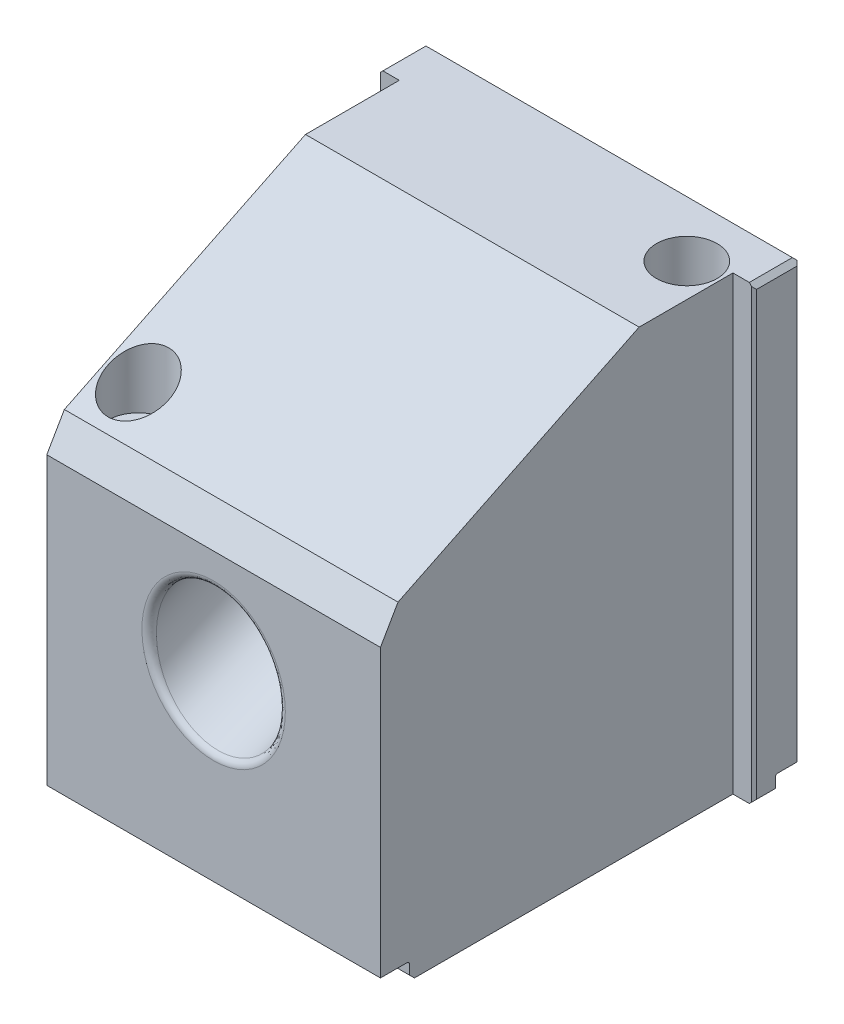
ISO-10303-21;
HEADER;
FILE_DESCRIPTION(('STEP AP214'),'2;1');
FILE_NAME('part.step','',(''),(''),'','','');
FILE_SCHEMA(('AUTOMOTIVE_DESIGN { 1 0 10303 214 1 1 1 1 }'));
ENDSEC;
DATA;
#1=APPLICATION_CONTEXT('core data for automotive mechanical design processes');
#2=APPLICATION_PROTOCOL_DEFINITION('international standard','automotive_design',2000,#1);
#3=PRODUCT_CONTEXT('',#1,'mechanical');
#4=PRODUCT('Part','Part','',(#3));
#5=PRODUCT_RELATED_PRODUCT_CATEGORY('part','',(#4));
#6=PRODUCT_DEFINITION_FORMATION('','',#4);
#7=PRODUCT_DEFINITION_CONTEXT('part definition',#1,'design');
#8=PRODUCT_DEFINITION('design','',#6,#7);
#9=PRODUCT_DEFINITION_SHAPE('','',#8);
#10=(LENGTH_UNIT() NAMED_UNIT(*) SI_UNIT(.MILLI.,.METRE.));
#11=(NAMED_UNIT(*) PLANE_ANGLE_UNIT() SI_UNIT($,.RADIAN.));
#12=(NAMED_UNIT(*) SI_UNIT($,.STERADIAN.) SOLID_ANGLE_UNIT());
#13=UNCERTAINTY_MEASURE_WITH_UNIT(LENGTH_MEASURE(1.E-05),#10,'distance_accuracy_value','');
#14=(GEOMETRIC_REPRESENTATION_CONTEXT(3) GLOBAL_UNCERTAINTY_ASSIGNED_CONTEXT((#13)) GLOBAL_UNIT_ASSIGNED_CONTEXT((#10,
#11,#12)) REPRESENTATION_CONTEXT('',''));
#15=CARTESIAN_POINT('',(0.,0.,0.));
#16=DIRECTION('',(0.,0.,1.));
#17=DIRECTION('',(1.,0.,0.));
#18=AXIS2_PLACEMENT_3D('',#15,#16,#17);
#19=CARTESIAN_POINT('',(-10.541,11.43,-34.036));
#20=DIRECTION('',(0.,0.,1.));
#21=DIRECTION('',(1.,0.,0.));
#22=AXIS2_PLACEMENT_3D('',#19,#20,#21);
#23=PLANE('',#22);
#24=CARTESIAN_POINT('',(-10.541,11.43,-34.036));
#25=DIRECTION('',(0.,0.,1.));
#26=DIRECTION('',(1.,0.,0.));
#27=AXIS2_PLACEMENT_3D('',#24,#25,#26);
#28=CIRCLE('',#27,6.35);
#29=CARTESIAN_POINT('',(-4.191,11.43,-34.036));
#30=VERTEX_POINT('',#29);
#31=EDGE_CURVE('E450',#30,#30,#28,.T.);
#32=ORIENTED_EDGE('',*,*,#31,.F.);
#33=EDGE_LOOP('',(#32));
#34=FACE_BOUND('',#33,.T.);
#35=CARTESIAN_POINT('',(-10.541,15.24,-34.036));
#36=DIRECTION('',(0.,0.,1.));
#37=DIRECTION('',(1.,0.,0.));
#38=AXIS2_PLACEMENT_3D('',#35,#36,#37);
#39=CIRCLE('',#38,0.889);
#40=CARTESIAN_POINT('',(-9.652,15.24,-34.036));
#41=VERTEX_POINT('',#40);
#42=EDGE_CURVE('E1257',#41,#41,#39,.T.);
#43=ORIENTED_EDGE('',*,*,#42,.T.);
#44=EDGE_LOOP('',(#43));
#45=FACE_BOUND('',#44,.T.);
#46=DIRECTION('',(-0.999999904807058,-0.000436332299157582,0.));
#47=VECTOR('',#46,1.);
#48=CARTESIAN_POINT('',(-11.6331998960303,15.2395234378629,-34.036));
#49=LINE('',#48,#47);
#50=CARTESIAN_POINT('',(-11.6334538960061,15.2395233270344,-34.036));
#51=VERTEX_POINT('',#50);
#52=CARTESIAN_POINT('',(-11.6331998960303,15.2395234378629,-34.036));
#53=VERTEX_POINT('',#52);
#54=EDGE_CURVE('E291',#51,#53,#49,.F.);
#55=ORIENTED_EDGE('',*,*,#54,.F.);
#56=CARTESIAN_POINT('',(-10.541,15.24,-34.036));
#57=DIRECTION('',(0.,0.,-1.));
#58=DIRECTION('',(-1.,0.,0.));
#59=AXIS2_PLACEMENT_3D('',#56,#57,#58);
#60=CIRCLE('',#59,1.092454);
#61=CARTESIAN_POINT('',(-11.633454,15.24,-34.036));
#62=VERTEX_POINT('',#61);
#63=EDGE_CURVE('E1341',#62,#51,#60,.T.);
#64=ORIENTED_EDGE('',*,*,#63,.F.);
#65=DIRECTION('',(-1.,0.,0.));
#66=VECTOR('',#65,1.);
#67=CARTESIAN_POINT('',(-11.6332,15.24,-34.036));
#68=LINE('',#67,#66);
#69=CARTESIAN_POINT('',(-11.6332,15.24,-34.036));
#70=VERTEX_POINT('',#69);
#71=EDGE_CURVE('E31',#62,#70,#68,.F.);
#72=ORIENTED_EDGE('',*,*,#71,.T.);
#73=CARTESIAN_POINT('',(-10.541,15.24,-34.036));
#74=DIRECTION('',(0.,0.,-1.));
#75=DIRECTION('',(-1.,0.,0.));
#76=AXIS2_PLACEMENT_3D('',#73,#74,#75);
#77=CIRCLE('',#76,1.0922);
#78=EDGE_CURVE('E1343',#70,#53,#77,.T.);
#79=ORIENTED_EDGE('',*,*,#78,.T.);
#80=EDGE_LOOP('',(#55,#64,#72,#79));
#81=FACE_BOUND('',#80,.T.);
#82=ADVANCED_FACE('F16',(#34,#45,#81),#23,.F.);
#83=CARTESIAN_POINT('',(-19.685,45.466,-41.656));
#84=DIRECTION('',(0.,0.,-1.));
#85=DIRECTION('',(-1.,0.,0.));
#86=AXIS2_PLACEMENT_3D('',#83,#84,#85);
#87=PLANE('',#86);
#88=DIRECTION('',(-1.,0.,0.));
#89=VECTOR('',#88,1.);
#90=CARTESIAN_POINT('',(140.610825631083,1.778,-41.656));
#91=LINE('',#90,#89);
#92=CARTESIAN_POINT('',(-9.525,1.778,-41.656));
#93=VERTEX_POINT('',#92);
#94=CARTESIAN_POINT('',(-19.431,1.778,-41.656));
#95=VERTEX_POINT('',#94);
#96=EDGE_CURVE('E1210',#93,#95,#91,.T.);
#97=ORIENTED_EDGE('',*,*,#96,.T.);
#98=DIRECTION('',(0.,1.,0.));
#99=VECTOR('',#98,1.);
#100=CARTESIAN_POINT('',(-19.431,45.466,-41.656));
#101=LINE('',#100,#99);
#102=CARTESIAN_POINT('',(-19.431,46.99,-41.656));
#103=VERTEX_POINT('',#102);
#104=EDGE_CURVE('E558',#95,#103,#101,.T.);
#105=ORIENTED_EDGE('',*,*,#104,.T.);
#106=DIRECTION('',(1.,0.,0.));
#107=VECTOR('',#106,1.);
#108=CARTESIAN_POINT('',(-9.525,46.99,-41.656));
#109=LINE('',#108,#107);
#110=CARTESIAN_POINT('',(-9.525,46.99,-41.656));
#111=VERTEX_POINT('',#110);
#112=EDGE_CURVE('E499',#103,#111,#109,.T.);
#113=ORIENTED_EDGE('',*,*,#112,.T.);
#114=DIRECTION('',(0.,-1.,0.));
#115=VECTOR('',#114,1.);
#116=CARTESIAN_POINT('',(-9.525,23.622,-41.656));
#117=LINE('',#116,#115);
#118=CARTESIAN_POINT('',(-9.525,17.6981930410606,-41.656));
#119=VERTEX_POINT('',#118);
#120=EDGE_CURVE('E300',#111,#119,#117,.T.);
#121=ORIENTED_EDGE('',*,*,#120,.T.);
#122=CARTESIAN_POINT('',(-10.541,11.43,-41.656));
#123=DIRECTION('',(0.,0.,-1.));
#124=DIRECTION('',(-1.,0.,0.));
#125=AXIS2_PLACEMENT_3D('',#122,#123,#124);
#126=CIRCLE('',#125,6.35);
#127=CARTESIAN_POINT('',(-9.525,5.16180695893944,-41.656));
#128=VERTEX_POINT('',#127);
#129=EDGE_CURVE('E651',#128,#119,#126,.T.);
#130=ORIENTED_EDGE('',*,*,#129,.F.);
#131=DIRECTION('',(0.,1.,0.));
#132=VECTOR('',#131,1.);
#133=CARTESIAN_POINT('',(-9.525,45.466,-41.656));
#134=LINE('',#133,#132);
#135=EDGE_CURVE('E422',#93,#128,#134,.T.);
#136=ORIENTED_EDGE('',*,*,#135,.F.);
#137=EDGE_LOOP('',(#97,#105,#113,#121,#130,#136));
#138=FACE_BOUND('',#137,.T.);
#139=ADVANCED_FACE('F351',(#138),#87,.T.);
#140=CARTESIAN_POINT('',(140.610825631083,1.778,0.));
#141=DIRECTION('',(0.,1.,0.));
#142=DIRECTION('',(0.,0.,1.));
#143=AXIS2_PLACEMENT_3D('',#140,#141,#142);
#144=PLANE('',#143);
#145=DIRECTION('',(0.,0.,-1.));
#146=VECTOR('',#145,1.);
#147=CARTESIAN_POINT('',(-17.4625,1.778,0.));
#148=LINE('',#147,#146);
#149=CARTESIAN_POINT('',(-17.4625,1.778,0.));
#150=VERTEX_POINT('',#149);
#151=CARTESIAN_POINT('',(-17.4625,1.778,-2.794));
#152=VERTEX_POINT('',#151);
#153=EDGE_CURVE('E1244',#150,#152,#148,.T.);
#154=ORIENTED_EDGE('',*,*,#153,.T.);
#155=DIRECTION('',(-1.,0.,0.));
#156=VECTOR('',#155,1.);
#157=CARTESIAN_POINT('',(17.4625,1.778,-2.794));
#158=LINE('',#157,#156);
#159=CARTESIAN_POINT('',(17.4625,1.778,-2.794));
#160=VERTEX_POINT('',#159);
#161=EDGE_CURVE('E483',#152,#160,#158,.F.);
#162=ORIENTED_EDGE('',*,*,#161,.T.);
#163=DIRECTION('',(0.,0.,1.));
#164=VECTOR('',#163,1.);
#165=CARTESIAN_POINT('',(17.4625,1.778,-36.89604));
#166=LINE('',#165,#164);
#167=CARTESIAN_POINT('',(17.4625,1.778,0.));
#168=VERTEX_POINT('',#167);
#169=EDGE_CURVE('E1242',#160,#168,#166,.T.);
#170=ORIENTED_EDGE('',*,*,#169,.T.);
#171=DIRECTION('',(-1.,0.,0.));
#172=VECTOR('',#171,1.);
#173=CARTESIAN_POINT('',(140.610825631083,1.778,0.));
#174=LINE('',#173,#172);
#175=EDGE_CURVE('E654',#168,#150,#174,.T.);
#176=ORIENTED_EDGE('',*,*,#175,.T.);
#177=EDGE_LOOP('',(#154,#162,#170,#176));
#178=FACE_BOUND('',#177,.T.);
#179=ADVANCED_FACE('F366',(#178),#144,.F.);
#180=CARTESIAN_POINT('',(140.610825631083,1.778,-3.048));
#181=DIRECTION('',(0.,0.,-1.));
#182=DIRECTION('',(-1.,0.,0.));
#183=AXIS2_PLACEMENT_3D('',#180,#181,#182);
#184=PLANE('',#183);
#185=DIRECTION('',(0.,1.,0.));
#186=VECTOR('',#185,1.);
#187=CARTESIAN_POINT('',(17.4625,45.466,-3.048));
#188=LINE('',#187,#186);
#189=CARTESIAN_POINT('',(17.4625,0.508,-3.048));
#190=VERTEX_POINT('',#189);
#191=CARTESIAN_POINT('',(17.4625,1.524,-3.048));
#192=VERTEX_POINT('',#191);
#193=EDGE_CURVE('E1237',#190,#192,#188,.T.);
#194=ORIENTED_EDGE('',*,*,#193,.T.);
#195=DIRECTION('',(-1.,0.,0.));
#196=VECTOR('',#195,1.);
#197=CARTESIAN_POINT('',(-17.4625,1.524,-3.048));
#198=LINE('',#197,#196);
#199=CARTESIAN_POINT('',(-17.4625,1.524,-3.048));
#200=VERTEX_POINT('',#199);
#201=EDGE_CURVE('E480',#192,#200,#198,.T.);
#202=ORIENTED_EDGE('',*,*,#201,.T.);
#203=DIRECTION('',(0.,-1.,0.));
#204=VECTOR('',#203,1.);
#205=CARTESIAN_POINT('',(-17.4625,45.466,-3.048));
#206=LINE('',#205,#204);
#207=CARTESIAN_POINT('',(-17.4625,0.508,-3.048));
#208=VERTEX_POINT('',#207);
#209=EDGE_CURVE('E642',#200,#208,#206,.T.);
#210=ORIENTED_EDGE('',*,*,#209,.T.);
#211=DIRECTION('',(1.,0.,0.));
#212=VECTOR('',#211,1.);
#213=CARTESIAN_POINT('',(17.4625,0.508,-3.048));
#214=LINE('',#213,#212);
#215=EDGE_CURVE('E471',#208,#190,#214,.T.);
#216=ORIENTED_EDGE('',*,*,#215,.T.);
#217=EDGE_LOOP('',(#194,#202,#210,#216));
#218=FACE_BOUND('',#217,.T.);
#219=ADVANCED_FACE('F362',(#218),#184,.F.);
#220=CARTESIAN_POINT('',(-19.685,45.466,-36.89604));
#221=DIRECTION('',(-1.,0.,0.));
#222=DIRECTION('',(0.,0.,1.));
#223=AXIS2_PLACEMENT_3D('',#220,#221,#222);
#224=PLANE('',#223);
#225=DIRECTION('',(0.,0.,-1.));
#226=VECTOR('',#225,1.);
#227=CARTESIAN_POINT('',(-19.685,46.736,-41.402));
#228=LINE('',#227,#226);
#229=CARTESIAN_POINT('',(-19.685,46.736,-37.15004));
#230=VERTEX_POINT('',#229);
#231=CARTESIAN_POINT('',(-19.685,46.736,-41.402));
#232=VERTEX_POINT('',#231);
#233=EDGE_CURVE('E522',#230,#232,#228,.T.);
#234=ORIENTED_EDGE('',*,*,#233,.T.);
#235=DIRECTION('',(0.,-1.,0.));
#236=VECTOR('',#235,1.);
#237=CARTESIAN_POINT('',(-19.685,45.466,-41.402));
#238=LINE('',#237,#236);
#239=CARTESIAN_POINT('',(-19.685,1.778,-41.402));
#240=VERTEX_POINT('',#239);
#241=EDGE_CURVE('E551',#232,#240,#238,.T.);
#242=ORIENTED_EDGE('',*,*,#241,.T.);
#243=DIRECTION('',(0.,0.,-1.));
#244=VECTOR('',#243,1.);
#245=CARTESIAN_POINT('',(-19.685,1.778,-36.89604));
#246=LINE('',#245,#244);
#247=CARTESIAN_POINT('',(-19.685,1.778,-39.37));
#248=VERTEX_POINT('',#247);
#249=EDGE_CURVE('E606',#248,#240,#246,.T.);
#250=ORIENTED_EDGE('',*,*,#249,.F.);
#251=CARTESIAN_POINT('',(-19.685,1.524,-39.37));
#252=DIRECTION('',(-1.,0.,0.));
#253=DIRECTION('',(0.,0.,1.));
#254=AXIS2_PLACEMENT_3D('',#251,#252,#253);
#255=CIRCLE('',#254,0.254);
#256=CARTESIAN_POINT('',(-19.685,1.524,-39.116));
#257=VERTEX_POINT('',#256);
#258=EDGE_CURVE('E485',#248,#257,#255,.F.);
#259=ORIENTED_EDGE('',*,*,#258,.T.);
#260=DIRECTION('',(0.,1.,0.));
#261=VECTOR('',#260,1.);
#262=CARTESIAN_POINT('',(-19.685,45.466,-39.116));
#263=LINE('',#262,#261);
#264=CARTESIAN_POINT('',(-19.685,0.508,-39.116));
#265=VERTEX_POINT('',#264);
#266=EDGE_CURVE('E618',#265,#257,#263,.T.);
#267=ORIENTED_EDGE('',*,*,#266,.F.);
#268=DIRECTION('',(0.,0.,1.));
#269=VECTOR('',#268,1.);
#270=CARTESIAN_POINT('',(-19.685,0.508,-36.89604));
#271=LINE('',#270,#269);
#272=CARTESIAN_POINT('',(-19.685,0.508,-37.15004));
#273=VERTEX_POINT('',#272);
#274=EDGE_CURVE('E519',#265,#273,#271,.T.);
#275=ORIENTED_EDGE('',*,*,#274,.T.);
#276=DIRECTION('',(0.,1.,0.));
#277=VECTOR('',#276,1.);
#278=CARTESIAN_POINT('',(-19.685,45.466,-37.15004));
#279=LINE('',#278,#277);
#280=EDGE_CURVE('E549',#273,#230,#279,.T.);
#281=ORIENTED_EDGE('',*,*,#280,.T.);
#282=EDGE_LOOP('',(#234,#242,#250,#259,#267,#275,#281));
#283=FACE_BOUND('',#282,.T.);
#284=ADVANCED_FACE('F365',(#283),#224,.T.);
#285=CARTESIAN_POINT('',(19.685,45.466,-41.656));
#286=DIRECTION('',(1.,0.,0.));
#287=DIRECTION('',(0.,0.,-1.));
#288=AXIS2_PLACEMENT_3D('',#285,#286,#287);
#289=PLANE('',#288);
#290=DIRECTION('',(0.,0.,1.));
#291=VECTOR('',#290,1.);
#292=CARTESIAN_POINT('',(19.685,1.778,-41.656));
#293=LINE('',#292,#291);
#294=CARTESIAN_POINT('',(19.685,1.778,-41.402));
#295=VERTEX_POINT('',#294);
#296=CARTESIAN_POINT('',(19.685,1.778,-39.37));
#297=VERTEX_POINT('',#296);
#298=EDGE_CURVE('E600',#295,#297,#293,.T.);
#299=ORIENTED_EDGE('',*,*,#298,.F.);
#300=DIRECTION('',(0.,1.,0.));
#301=VECTOR('',#300,1.);
#302=CARTESIAN_POINT('',(19.685,45.466,-41.402));
#303=LINE('',#302,#301);
#304=CARTESIAN_POINT('',(19.685,46.736,-41.402));
#305=VERTEX_POINT('',#304);
#306=EDGE_CURVE('E575',#295,#305,#303,.T.);
#307=ORIENTED_EDGE('',*,*,#306,.T.);
#308=DIRECTION('',(0.,0.,1.));
#309=VECTOR('',#308,1.);
#310=CARTESIAN_POINT('',(19.685,46.736,-36.89604));
#311=LINE('',#310,#309);
#312=CARTESIAN_POINT('',(19.685,46.736,-37.15004));
#313=VERTEX_POINT('',#312);
#314=EDGE_CURVE('E541',#305,#313,#311,.T.);
#315=ORIENTED_EDGE('',*,*,#314,.T.);
#316=DIRECTION('',(0.,-1.,0.));
#317=VECTOR('',#316,1.);
#318=CARTESIAN_POINT('',(19.685,45.466,-37.15004));
#319=LINE('',#318,#317);
#320=CARTESIAN_POINT('',(19.685,0.508,-37.15004));
#321=VERTEX_POINT('',#320);
#322=EDGE_CURVE('E572',#313,#321,#319,.T.);
#323=ORIENTED_EDGE('',*,*,#322,.T.);
#324=DIRECTION('',(0.,0.,-1.));
#325=VECTOR('',#324,1.);
#326=CARTESIAN_POINT('',(19.685,0.508,-41.656));
#327=LINE('',#326,#325);
#328=CARTESIAN_POINT('',(19.685,0.508,-39.116));
#329=VERTEX_POINT('',#328);
#330=EDGE_CURVE('E544',#321,#329,#327,.T.);
#331=ORIENTED_EDGE('',*,*,#330,.T.);
#332=DIRECTION('',(0.,-1.,0.));
#333=VECTOR('',#332,1.);
#334=CARTESIAN_POINT('',(19.685,45.466,-39.116));
#335=LINE('',#334,#333);
#336=CARTESIAN_POINT('',(19.685,1.524,-39.116));
#337=VERTEX_POINT('',#336);
#338=EDGE_CURVE('E609',#337,#329,#335,.T.);
#339=ORIENTED_EDGE('',*,*,#338,.F.);
#340=CARTESIAN_POINT('',(19.685,1.524,-39.37));
#341=DIRECTION('',(1.,0.,0.));
#342=DIRECTION('',(0.,0.,-1.));
#343=AXIS2_PLACEMENT_3D('',#340,#341,#342);
#344=CIRCLE('',#343,0.254);
#345=EDGE_CURVE('E487',#337,#297,#344,.F.);
#346=ORIENTED_EDGE('',*,*,#345,.T.);
#347=EDGE_LOOP('',(#299,#307,#315,#323,#331,#339,#346));
#348=FACE_BOUND('',#347,.T.);
#349=ADVANCED_FACE('F387',(#348),#289,.T.);
#350=CARTESIAN_POINT('',(17.4625,0.,-36.89604));
#351=DIRECTION('',(0.,-1.,0.));
#352=DIRECTION('',(0.,0.,-1.));
#353=AXIS2_PLACEMENT_3D('',#350,#351,#352);
#354=PLANE('',#353);
#355=DIRECTION('',(-1.,0.,0.));
#356=VECTOR('',#355,1.);
#357=CARTESIAN_POINT('',(-17.4625,0.,-36.89604));
#358=LINE('',#357,#356);
#359=CARTESIAN_POINT('',(-17.4625,0.,-36.89604));
#360=VERTEX_POINT('',#359);
#361=CARTESIAN_POINT('',(-19.177,0.,-36.89604));
#362=VERTEX_POINT('',#361);
#363=EDGE_CURVE('E624',#360,#362,#358,.T.);
#364=ORIENTED_EDGE('',*,*,#363,.T.);
#365=DIRECTION('',(0.,0.,-1.));
#366=VECTOR('',#365,1.);
#367=CARTESIAN_POINT('',(-19.177,0.,-36.89604));
#368=LINE('',#367,#366);
#369=CARTESIAN_POINT('',(-19.177,0.,-38.608));
#370=VERTEX_POINT('',#369);
#371=EDGE_CURVE('E530',#362,#370,#368,.T.);
#372=ORIENTED_EDGE('',*,*,#371,.T.);
#373=DIRECTION('',(1.,0.,0.));
#374=VECTOR('',#373,1.);
#375=CARTESIAN_POINT('',(19.685,0.,-38.608));
#376=LINE('',#375,#374);
#377=CARTESIAN_POINT('',(19.177,0.,-38.608));
#378=VERTEX_POINT('',#377);
#379=EDGE_CURVE('E465',#370,#378,#376,.T.);
#380=ORIENTED_EDGE('',*,*,#379,.T.);
#381=DIRECTION('',(0.,0.,1.));
#382=VECTOR('',#381,1.);
#383=CARTESIAN_POINT('',(19.177,0.,-36.89604));
#384=LINE('',#383,#382);
#385=CARTESIAN_POINT('',(19.177,0.,-36.89604));
#386=VERTEX_POINT('',#385);
#387=EDGE_CURVE('E527',#378,#386,#384,.T.);
#388=ORIENTED_EDGE('',*,*,#387,.T.);
#389=DIRECTION('',(-1.,0.,0.));
#390=VECTOR('',#389,1.);
#391=CARTESIAN_POINT('',(19.685,0.,-36.89604));
#392=LINE('',#391,#390);
#393=CARTESIAN_POINT('',(17.4625,0.,-36.89604));
#394=VERTEX_POINT('',#393);
#395=EDGE_CURVE('E627',#386,#394,#392,.T.);
#396=ORIENTED_EDGE('',*,*,#395,.T.);
#397=DIRECTION('',(0.,0.,1.));
#398=VECTOR('',#397,1.);
#399=CARTESIAN_POINT('',(17.4625,0.,-36.89604));
#400=LINE('',#399,#398);
#401=CARTESIAN_POINT('',(17.4625,0.,-3.556));
#402=VERTEX_POINT('',#401);
#403=EDGE_CURVE('E621',#394,#402,#400,.T.);
#404=ORIENTED_EDGE('',*,*,#403,.T.);
#405=DIRECTION('',(-1.,0.,0.));
#406=VECTOR('',#405,1.);
#407=CARTESIAN_POINT('',(-17.4625,0.,-3.556));
#408=LINE('',#407,#406);
#409=CARTESIAN_POINT('',(-17.4625,0.,-3.556));
#410=VERTEX_POINT('',#409);
#411=EDGE_CURVE('E462',#402,#410,#408,.T.);
#412=ORIENTED_EDGE('',*,*,#411,.T.);
#413=DIRECTION('',(0.,0.,-1.));
#414=VECTOR('',#413,1.);
#415=CARTESIAN_POINT('',(-17.4625,0.,0.));
#416=LINE('',#415,#414);
#417=EDGE_CURVE('E622',#410,#360,#416,.T.);
#418=ORIENTED_EDGE('',*,*,#417,.T.);
#419=EDGE_LOOP('',(#364,#372,#380,#388,#396,#404,#412,#418));
#420=FACE_BOUND('',#419,.T.);
#421=CARTESIAN_POINT('',(-13.97,0.,-6.096));
#422=DIRECTION('',(0.,-1.,0.));
#423=DIRECTION('',(0.,0.,-1.));
#424=AXIS2_PLACEMENT_3D('',#421,#422,#423);
#425=CIRCLE('',#424,2.0447);
#426=CARTESIAN_POINT('',(-13.97,0.,-8.1407));
#427=VERTEX_POINT('',#426);
#428=EDGE_CURVE('E439',#427,#427,#425,.T.);
#429=ORIENTED_EDGE('',*,*,#428,.F.);
#430=EDGE_LOOP('',(#429));
#431=FACE_BOUND('',#430,.T.);
#432=CARTESIAN_POINT('',(13.97,0.,-35.56));
#433=DIRECTION('',(0.,-1.,0.));
#434=DIRECTION('',(0.,0.,-1.));
#435=AXIS2_PLACEMENT_3D('',#432,#433,#434);
#436=CIRCLE('',#435,2.0447);
#437=CARTESIAN_POINT('',(13.97,0.,-37.6047));
#438=VERTEX_POINT('',#437);
#439=EDGE_CURVE('E442',#438,#438,#436,.T.);
#440=ORIENTED_EDGE('',*,*,#439,.F.);
#441=EDGE_LOOP('',(#440));
#442=FACE_BOUND('',#441,.T.);
#443=ADVANCED_FACE('F383',(#420,#431,#442),#354,.T.);
#444=CARTESIAN_POINT('',(-17.4625,45.466,-36.89604));
#445=DIRECTION('',(0.,0.,1.));
#446=DIRECTION('',(1.,0.,0.));
#447=AXIS2_PLACEMENT_3D('',#444,#445,#446);
#448=PLANE('',#447);
#449=DIRECTION('',(-0.707106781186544,-0.707106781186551,0.));
#450=VECTOR('',#449,1.);
#451=CARTESIAN_POINT('',(-19.20875,47.21225,-36.89604));
#452=LINE('',#451,#450);
#453=CARTESIAN_POINT('',(-19.177,47.244,-36.89604));
#454=VERTEX_POINT('',#453);
#455=CARTESIAN_POINT('',(-19.431,46.99,-36.89604));
#456=VERTEX_POINT('',#455);
#457=EDGE_CURVE('E516',#454,#456,#452,.T.);
#458=ORIENTED_EDGE('',*,*,#457,.T.);
#459=DIRECTION('',(0.,-1.,0.));
#460=VECTOR('',#459,1.);
#461=CARTESIAN_POINT('',(-19.431,45.466,-36.89604));
#462=LINE('',#461,#460);
#463=CARTESIAN_POINT('',(-19.431,0.254,-36.89604));
#464=VERTEX_POINT('',#463);
#465=EDGE_CURVE('E564',#456,#464,#462,.T.);
#466=ORIENTED_EDGE('',*,*,#465,.T.);
#467=DIRECTION('',(-0.707106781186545,0.70710678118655,0.));
#468=VECTOR('',#467,1.);
#469=CARTESIAN_POINT('',(-41.05275,21.87575,-36.89604));
#470=LINE('',#469,#468);
#471=EDGE_CURVE('E514',#464,#362,#470,.F.);
#472=ORIENTED_EDGE('',*,*,#471,.T.);
#473=ORIENTED_EDGE('',*,*,#363,.F.);
#474=DIRECTION('',(0.,-1.,0.));
#475=VECTOR('',#474,1.);
#476=CARTESIAN_POINT('',(-17.4625,45.466,-36.89604));
#477=LINE('',#476,#475);
#478=CARTESIAN_POINT('',(-17.4625,47.244,-36.89604));
#479=VERTEX_POINT('',#478);
#480=EDGE_CURVE('E634',#479,#360,#477,.T.);
#481=ORIENTED_EDGE('',*,*,#480,.F.);
#482=DIRECTION('',(1.,0.,0.));
#483=VECTOR('',#482,1.);
#484=CARTESIAN_POINT('',(-17.4625,47.244,-36.89604));
#485=LINE('',#484,#483);
#486=EDGE_CURVE('E1231',#454,#479,#485,.T.);
#487=ORIENTED_EDGE('',*,*,#486,.F.);
#488=EDGE_LOOP('',(#458,#466,#472,#473,#481,#487));
#489=FACE_BOUND('',#488,.T.);
#490=ADVANCED_FACE('F386',(#489),#448,.T.);
#491=DIRECTION('',(1.,0.,0.));
#492=VECTOR('',#491,1.);
#493=CARTESIAN_POINT('',(19.685,46.99,-41.656));
#494=LINE('',#493,#492);
#495=CARTESIAN_POINT('',(9.525,46.99,-41.656));
#496=VERTEX_POINT('',#495);
#497=CARTESIAN_POINT('',(19.431,46.99,-41.656));
#498=VERTEX_POINT('',#497);
#499=EDGE_CURVE('E505',#496,#498,#494,.T.);
#500=ORIENTED_EDGE('',*,*,#499,.T.);
#501=DIRECTION('',(0.,-1.,0.));
#502=VECTOR('',#501,1.);
#503=CARTESIAN_POINT('',(19.431,45.466,-41.656));
#504=LINE('',#503,#502);
#505=CARTESIAN_POINT('',(19.431,1.778,-41.656));
#506=VERTEX_POINT('',#505);
#507=EDGE_CURVE('E569',#498,#506,#504,.T.);
#508=ORIENTED_EDGE('',*,*,#507,.T.);
#509=CARTESIAN_POINT('',(9.525,1.778,-41.656));
#510=VERTEX_POINT('',#509);
#511=EDGE_CURVE('E602',#506,#510,#91,.T.);
#512=ORIENTED_EDGE('',*,*,#511,.T.);
#513=DIRECTION('',(0.,-1.,0.));
#514=VECTOR('',#513,1.);
#515=CARTESIAN_POINT('',(9.525,23.622,-41.656));
#516=LINE('',#515,#514);
#517=EDGE_CURVE('E596',#496,#510,#516,.T.);
#518=ORIENTED_EDGE('',*,*,#517,.F.);
#519=EDGE_LOOP('',(#500,#508,#512,#518));
#520=FACE_BOUND('',#519,.T.);
#521=ADVANCED_FACE('F393',(#520),#87,.T.);
#522=CARTESIAN_POINT('',(19.685,45.466,-36.89604));
#523=DIRECTION('',(0.,0.,1.));
#524=DIRECTION('',(1.,0.,0.));
#525=AXIS2_PLACEMENT_3D('',#522,#523,#524);
#526=PLANE('',#525);
#527=DIRECTION('',(-0.707106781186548,-0.707106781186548,0.));
#528=VECTOR('',#527,1.);
#529=CARTESIAN_POINT('',(42.164,22.987,-36.89604));
#530=LINE('',#529,#528);
#531=CARTESIAN_POINT('',(19.431,0.253999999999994,-36.89604));
#532=VERTEX_POINT('',#531);
#533=EDGE_CURVE('E539',#386,#532,#530,.F.);
#534=ORIENTED_EDGE('',*,*,#533,.T.);
#535=DIRECTION('',(0.,1.,0.));
#536=VECTOR('',#535,1.);
#537=CARTESIAN_POINT('',(19.431,45.466,-36.89604));
#538=LINE('',#537,#536);
#539=CARTESIAN_POINT('',(19.431,46.99,-36.89604));
#540=VERTEX_POINT('',#539);
#541=EDGE_CURVE('E10',#532,#540,#538,.T.);
#542=ORIENTED_EDGE('',*,*,#541,.T.);
#543=DIRECTION('',(-0.707106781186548,0.707106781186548,0.));
#544=VECTOR('',#543,1.);
#545=CARTESIAN_POINT('',(20.32,46.101,-36.89604));
#546=LINE('',#545,#544);
#547=CARTESIAN_POINT('',(19.177,47.244,-36.89604));
#548=VERTEX_POINT('',#547);
#549=EDGE_CURVE('E537',#540,#548,#546,.T.);
#550=ORIENTED_EDGE('',*,*,#549,.T.);
#551=DIRECTION('',(1.,0.,0.));
#552=VECTOR('',#551,1.);
#553=CARTESIAN_POINT('',(19.685,47.244,-36.89604));
#554=LINE('',#553,#552);
#555=CARTESIAN_POINT('',(17.4625,47.244,-36.89604));
#556=VERTEX_POINT('',#555);
#557=EDGE_CURVE('E607',#556,#548,#554,.T.);
#558=ORIENTED_EDGE('',*,*,#557,.F.);
#559=DIRECTION('',(0.,-1.,0.));
#560=VECTOR('',#559,1.);
#561=CARTESIAN_POINT('',(17.4625,45.466,-36.89604));
#562=LINE('',#561,#560);
#563=EDGE_CURVE('E629',#556,#394,#562,.T.);
#564=ORIENTED_EDGE('',*,*,#563,.T.);
#565=ORIENTED_EDGE('',*,*,#395,.F.);
#566=EDGE_LOOP('',(#534,#542,#550,#558,#564,#565));
#567=FACE_BOUND('',#566,.T.);
#568=ADVANCED_FACE('F389',(#567),#526,.T.);
#569=CARTESIAN_POINT('',(17.4625,45.466,-36.89604));
#570=DIRECTION('',(1.,0.,0.));
#571=DIRECTION('',(0.,0.,-1.));
#572=AXIS2_PLACEMENT_3D('',#569,#570,#571);
#573=PLANE('',#572);
#574=ORIENTED_EDGE('',*,*,#193,.F.);
#575=DIRECTION('',(0.,-0.707106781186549,-0.707106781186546));
#576=VECTOR('',#575,1.);
#577=CARTESIAN_POINT('',(17.4625,6.06298000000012,2.50698000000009));
#578=LINE('',#577,#576);
#579=EDGE_CURVE('E473',#190,#402,#578,.T.);
#580=ORIENTED_EDGE('',*,*,#579,.T.);
#581=ORIENTED_EDGE('',*,*,#403,.F.);
#582=ORIENTED_EDGE('',*,*,#563,.F.);
#583=DIRECTION('',(0.,0.,-1.));
#584=VECTOR('',#583,1.);
#585=CARTESIAN_POINT('',(17.4625,47.244,-36.89604));
#586=LINE('',#585,#584);
#587=CARTESIAN_POINT('',(17.4625,47.244,-27.0784907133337));
#588=VERTEX_POINT('',#587);
#589=EDGE_CURVE('E612',#588,#556,#586,.T.);
#590=ORIENTED_EDGE('',*,*,#589,.F.);
#591=DIRECTION('',(0.,0.438371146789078,-0.898794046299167));
#592=VECTOR('',#591,1.);
#593=CARTESIAN_POINT('',(17.4625,50.770490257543,-34.3088672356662));
#594=LINE('',#593,#592);
#595=CARTESIAN_POINT('',(17.4625,34.9333433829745,-1.83790415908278));
#596=VERTEX_POINT('',#595);
#597=EDGE_CURVE('E1235',#596,#588,#594,.T.);
#598=ORIENTED_EDGE('',*,*,#597,.F.);
#599=DIRECTION('',(0.,-0.866025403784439,0.5));
#600=VECTOR('',#599,1.);
#601=CARTESIAN_POINT('',(17.4625,58.0134539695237,-15.1632122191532));
#602=LINE('',#601,#600);
#603=CARTESIAN_POINT('',(17.4625,31.750000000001,0.));
#604=VERTEX_POINT('',#603);
#605=EDGE_CURVE('E453',#596,#604,#602,.T.);
#606=ORIENTED_EDGE('',*,*,#605,.T.);
#607=DIRECTION('',(0.,-1.,0.));
#608=VECTOR('',#607,1.);
#609=CARTESIAN_POINT('',(17.4625,45.466,0.));
#610=LINE('',#609,#608);
#611=EDGE_CURVE('E639',#604,#168,#610,.T.);
#612=ORIENTED_EDGE('',*,*,#611,.T.);
#613=ORIENTED_EDGE('',*,*,#169,.F.);
#614=CARTESIAN_POINT('',(17.4625,1.524,-2.794));
#615=DIRECTION('',(1.,0.,0.));
#616=DIRECTION('',(0.,0.,-1.));
#617=AXIS2_PLACEMENT_3D('',#614,#615,#616);
#618=CIRCLE('',#617,0.254);
#619=EDGE_CURVE('E492',#160,#192,#618,.F.);
#620=ORIENTED_EDGE('',*,*,#619,.T.);
#621=EDGE_LOOP('',(#574,#580,#581,#582,#590,#598,#606,#612,#613,#620));
#622=FACE_BOUND('',#621,.T.);
#623=ADVANCED_FACE('F392',(#622),#573,.T.);
#624=CARTESIAN_POINT('',(-17.4625,45.466,0.));
#625=DIRECTION('',(-1.,0.,0.));
#626=DIRECTION('',(0.,0.,1.));
#627=AXIS2_PLACEMENT_3D('',#624,#625,#626);
#628=PLANE('',#627);
#629=ORIENTED_EDGE('',*,*,#417,.F.);
#630=DIRECTION('',(0.,0.707106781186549,0.707106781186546));
#631=VECTOR('',#630,1.);
#632=CARTESIAN_POINT('',(-17.4625,24.511,20.955));
#633=LINE('',#632,#631);
#634=EDGE_CURVE('E468',#410,#208,#633,.T.);
#635=ORIENTED_EDGE('',*,*,#634,.T.);
#636=ORIENTED_EDGE('',*,*,#209,.F.);
#637=CARTESIAN_POINT('',(-17.4625,1.524,-2.794));
#638=DIRECTION('',(-1.,0.,0.));
#639=DIRECTION('',(0.,0.,1.));
#640=AXIS2_PLACEMENT_3D('',#637,#638,#639);
#641=CIRCLE('',#640,0.254);
#642=EDGE_CURVE('E490',#200,#152,#641,.F.);
#643=ORIENTED_EDGE('',*,*,#642,.T.);
#644=ORIENTED_EDGE('',*,*,#153,.F.);
#645=DIRECTION('',(0.,-1.,0.));
#646=VECTOR('',#645,1.);
#647=CARTESIAN_POINT('',(-17.4625,45.466,0.));
#648=LINE('',#647,#646);
#649=CARTESIAN_POINT('',(-17.4625,31.750000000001,0.));
#650=VERTEX_POINT('',#649);
#651=EDGE_CURVE('E637',#650,#150,#648,.T.);
#652=ORIENTED_EDGE('',*,*,#651,.F.);
#653=DIRECTION('',(0.,0.866025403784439,-0.5));
#654=VECTOR('',#653,1.);
#655=CARTESIAN_POINT('',(-17.4625,42.037,-5.93920221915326));
#656=LINE('',#655,#654);
#657=CARTESIAN_POINT('',(-17.4625,34.9333433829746,-1.8379041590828));
#658=VERTEX_POINT('',#657);
#659=EDGE_CURVE('E457',#650,#658,#656,.T.);
#660=ORIENTED_EDGE('',*,*,#659,.T.);
#661=DIRECTION('',(0.,-0.438371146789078,0.898794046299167));
#662=VECTOR('',#661,1.);
#663=CARTESIAN_POINT('',(-17.4625,36.2332521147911,-4.5031120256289));
#664=LINE('',#663,#662);
#665=CARTESIAN_POINT('',(-17.4625,47.244,-27.0784907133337));
#666=VERTEX_POINT('',#665);
#667=EDGE_CURVE('E644',#666,#658,#664,.T.);
#668=ORIENTED_EDGE('',*,*,#667,.F.);
#669=DIRECTION('',(0.,0.,1.));
#670=VECTOR('',#669,1.);
#671=CARTESIAN_POINT('',(-17.4625,47.244,0.));
#672=LINE('',#671,#670);
#673=EDGE_CURVE('E647',#479,#666,#672,.T.);
#674=ORIENTED_EDGE('',*,*,#673,.F.);
#675=ORIENTED_EDGE('',*,*,#480,.T.);
#676=EDGE_LOOP('',(#629,#635,#636,#643,#644,#652,#660,#668,#674,#675));
#677=FACE_BOUND('',#676,.T.);
#678=ADVANCED_FACE('F407',(#677),#628,.T.);
#679=CARTESIAN_POINT('',(17.4625,45.466,0.));
#680=DIRECTION('',(0.,0.,1.));
#681=DIRECTION('',(1.,0.,0.));
#682=AXIS2_PLACEMENT_3D('',#679,#680,#681);
#683=PLANE('',#682);
#684=ORIENTED_EDGE('',*,*,#611,.F.);
#685=DIRECTION('',(-1.,0.,0.));
#686=VECTOR('',#685,1.);
#687=CARTESIAN_POINT('',(-17.4625,31.750000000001,0.));
#688=LINE('',#687,#686);
#689=EDGE_CURVE('E455',#604,#650,#688,.T.);
#690=ORIENTED_EDGE('',*,*,#689,.T.);
#691=ORIENTED_EDGE('',*,*,#651,.T.);
#692=ORIENTED_EDGE('',*,*,#175,.F.);
#693=EDGE_LOOP('',(#684,#690,#691,#692));
#694=FACE_BOUND('',#693,.T.);
#695=CARTESIAN_POINT('',(0.,20.8980560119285,0.));
#696=DIRECTION('',(0.,0.,1.));
#697=DIRECTION('',(0.,-1.,0.));
#698=AXIS2_PLACEMENT_3D('',#695,#696,#697);
#699=ELLIPSE('',#698,8.15389508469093,7.5057);
#700=CARTESIAN_POINT('',(0.,12.7441609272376,0.));
#701=VERTEX_POINT('',#700);
#702=EDGE_CURVE('E420',#701,#701,#699,.F.);
#703=ORIENTED_EDGE('',*,*,#702,.T.);
#704=EDGE_LOOP('',(#703));
#705=FACE_BOUND('',#704,.T.);
#706=ADVANCED_FACE('F375',(#694,#705),#683,.T.);
#707=CARTESIAN_POINT('',(140.610825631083,47.244,-27.0784907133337));
#708=DIRECTION('',(0.,-0.898794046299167,-0.438371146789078));
#709=DIRECTION('',(0.,0.438371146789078,-0.898794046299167));
#710=AXIS2_PLACEMENT_3D('',#707,#708,#709);
#711=PLANE('',#710);
#712=CARTESIAN_POINT('',(-13.97,37.0101554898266,-6.096));
#713=DIRECTION('',(0.,-0.898794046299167,-0.438371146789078));
#714=DIRECTION('',(0.,-0.438371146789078,0.898794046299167));
#715=AXIS2_PLACEMENT_3D('',#712,#713,#714);
#716=ELLIPSE('',#715,3.53251116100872,3.175);
#717=CARTESIAN_POINT('',(-13.97,35.46160452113,-2.921));
#718=VERTEX_POINT('',#717);
#719=EDGE_CURVE('E437',#718,#718,#716,.T.);
#720=ORIENTED_EDGE('',*,*,#719,.T.);
#721=EDGE_LOOP('',(#720));
#722=FACE_BOUND('',#721,.T.);
#723=ORIENTED_EDGE('',*,*,#667,.T.);
#724=DIRECTION('',(1.,0.,0.));
#725=VECTOR('',#724,1.);
#726=CARTESIAN_POINT('',(17.4625,34.9333433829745,-1.83790415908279));
#727=LINE('',#726,#725);
#728=EDGE_CURVE('E433',#658,#596,#727,.T.);
#729=ORIENTED_EDGE('',*,*,#728,.T.);
#730=ORIENTED_EDGE('',*,*,#597,.T.);
#731=DIRECTION('',(-1.,0.,0.));
#732=VECTOR('',#731,1.);
#733=CARTESIAN_POINT('',(140.610825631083,47.244,-27.0784907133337));
#734=LINE('',#733,#732);
#735=EDGE_CURVE('E1215',#588,#666,#734,.T.);
#736=ORIENTED_EDGE('',*,*,#735,.T.);
#737=EDGE_LOOP('',(#723,#729,#730,#736));
#738=FACE_BOUND('',#737,.T.);
#739=ADVANCED_FACE('F371',(#722,#738),#711,.F.);
#740=CARTESIAN_POINT('',(140.610825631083,47.244,-41.656));
#741=DIRECTION('',(0.,-1.,0.));
#742=DIRECTION('',(0.,0.,-1.));
#743=AXIS2_PLACEMENT_3D('',#740,#741,#742);
#744=PLANE('',#743);
#745=CARTESIAN_POINT('',(13.97,47.244,-35.56));
#746=DIRECTION('',(0.,-1.,0.));
#747=DIRECTION('',(0.,0.,-1.));
#748=AXIS2_PLACEMENT_3D('',#745,#746,#747);
#749=CIRCLE('',#748,3.175);
#750=CARTESIAN_POINT('',(13.97,47.244,-38.735));
#751=VERTEX_POINT('',#750);
#752=EDGE_CURVE('E443',#751,#751,#749,.T.);
#753=ORIENTED_EDGE('',*,*,#752,.T.);
#754=EDGE_LOOP('',(#753));
#755=FACE_BOUND('',#754,.T.);
#756=DIRECTION('',(-1.,0.,0.));
#757=VECTOR('',#756,1.);
#758=CARTESIAN_POINT('',(-19.685,47.244,-41.402));
#759=LINE('',#758,#757);
#760=CARTESIAN_POINT('',(-9.525,47.244,-41.402));
#761=VERTEX_POINT('',#760);
#762=CARTESIAN_POINT('',(-19.177,47.244,-41.402));
#763=VERTEX_POINT('',#762);
#764=EDGE_CURVE('E496',#761,#763,#759,.T.);
#765=ORIENTED_EDGE('',*,*,#764,.T.);
#766=DIRECTION('',(0.,0.,1.));
#767=VECTOR('',#766,1.);
#768=CARTESIAN_POINT('',(-19.177,47.244,-36.89604));
#769=LINE('',#768,#767);
#770=EDGE_CURVE('E511',#763,#454,#769,.T.);
#771=ORIENTED_EDGE('',*,*,#770,.T.);
#772=ORIENTED_EDGE('',*,*,#486,.T.);
#773=ORIENTED_EDGE('',*,*,#673,.T.);
#774=ORIENTED_EDGE('',*,*,#735,.F.);
#775=ORIENTED_EDGE('',*,*,#589,.T.);
#776=ORIENTED_EDGE('',*,*,#557,.T.);
#777=DIRECTION('',(0.,0.,-1.));
#778=VECTOR('',#777,1.);
#779=CARTESIAN_POINT('',(19.177,47.244,-41.402));
#780=LINE('',#779,#778);
#781=CARTESIAN_POINT('',(19.177,47.244,-41.402));
#782=VERTEX_POINT('',#781);
#783=EDGE_CURVE('E508',#548,#782,#780,.T.);
#784=ORIENTED_EDGE('',*,*,#783,.T.);
#785=DIRECTION('',(-1.,0.,0.));
#786=VECTOR('',#785,1.);
#787=CARTESIAN_POINT('',(9.525,47.244,-41.402));
#788=LINE('',#787,#786);
#789=CARTESIAN_POINT('',(9.525,47.244,-41.402));
#790=VERTEX_POINT('',#789);
#791=EDGE_CURVE('E494',#782,#790,#788,.T.);
#792=ORIENTED_EDGE('',*,*,#791,.T.);
#793=DIRECTION('',(-1.,0.,0.));
#794=VECTOR('',#793,1.);
#795=CARTESIAN_POINT('',(140.610825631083,47.244,-41.402));
#796=LINE('',#795,#794);
#797=EDGE_CURVE('E424',#790,#761,#796,.T.);
#798=ORIENTED_EDGE('',*,*,#797,.T.);
#799=EDGE_LOOP('',(#765,#771,#772,#773,#774,#775,#776,#784,#792,#798));
#800=FACE_BOUND('',#799,.T.);
#801=ADVANCED_FACE('F374',(#755,#800),#744,.F.);
#802=CARTESIAN_POINT('',(140.610825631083,1.778,-39.116));
#803=DIRECTION('',(0.,1.,0.));
#804=DIRECTION('',(0.,0.,1.));
#805=AXIS2_PLACEMENT_3D('',#802,#803,#804);
#806=PLANE('',#805);
#807=ORIENTED_EDGE('',*,*,#249,.T.);
#808=DIRECTION('',(-0.707106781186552,0.,0.707106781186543));
#809=VECTOR('',#808,1.);
#810=CARTESIAN_POINT('',(-19.685,1.778,-41.402));
#811=LINE('',#810,#809);
#812=EDGE_CURVE('E556',#240,#95,#811,.F.);
#813=ORIENTED_EDGE('',*,*,#812,.T.);
#814=ORIENTED_EDGE('',*,*,#96,.F.);
#815=DIRECTION('',(0.,0.,1.));
#816=VECTOR('',#815,1.);
#817=CARTESIAN_POINT('',(-9.525,1.778,-39.116));
#818=LINE('',#817,#816);
#819=CARTESIAN_POINT('',(-9.525,1.778,-41.402));
#820=VERTEX_POINT('',#819);
#821=EDGE_CURVE('E1272',#93,#820,#818,.T.);
#822=ORIENTED_EDGE('',*,*,#821,.T.);
#823=DIRECTION('',(1.,0.,0.));
#824=VECTOR('',#823,1.);
#825=CARTESIAN_POINT('',(140.610825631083,1.778,-41.402));
#826=LINE('',#825,#824);
#827=CARTESIAN_POINT('',(9.525,1.778,-41.402));
#828=VERTEX_POINT('',#827);
#829=EDGE_CURVE('E1263',#820,#828,#826,.T.);
#830=ORIENTED_EDGE('',*,*,#829,.T.);
#831=DIRECTION('',(0.,0.,-1.));
#832=VECTOR('',#831,1.);
#833=CARTESIAN_POINT('',(9.525,1.778,-39.116));
#834=LINE('',#833,#832);
#835=EDGE_CURVE('E1274',#828,#510,#834,.T.);
#836=ORIENTED_EDGE('',*,*,#835,.T.);
#837=ORIENTED_EDGE('',*,*,#511,.F.);
#838=DIRECTION('',(-0.707106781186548,0.,-0.707106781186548));
#839=VECTOR('',#838,1.);
#840=CARTESIAN_POINT('',(19.431,1.778,-41.656));
#841=LINE('',#840,#839);
#842=EDGE_CURVE('E554',#506,#295,#841,.F.);
#843=ORIENTED_EDGE('',*,*,#842,.T.);
#844=ORIENTED_EDGE('',*,*,#298,.T.);
#845=DIRECTION('',(-1.,0.,0.));
#846=VECTOR('',#845,1.);
#847=CARTESIAN_POINT('',(-19.685,1.778,-39.37));
#848=LINE('',#847,#846);
#849=EDGE_CURVE('E475',#297,#248,#848,.T.);
#850=ORIENTED_EDGE('',*,*,#849,.T.);
#851=EDGE_LOOP('',(#807,#813,#814,#822,#830,#836,#837,#843,#844,#850));
#852=FACE_BOUND('',#851,.T.);
#853=ADVANCED_FACE('F360',(#852),#806,.F.);
#854=CARTESIAN_POINT('',(140.610825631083,0.,-39.116));
#855=DIRECTION('',(0.,0.,1.));
#856=DIRECTION('',(1.,0.,0.));
#857=AXIS2_PLACEMENT_3D('',#854,#855,#856);
#858=PLANE('',#857);
#859=ORIENTED_EDGE('',*,*,#266,.T.);
#860=DIRECTION('',(-1.,0.,0.));
#861=VECTOR('',#860,1.);
#862=CARTESIAN_POINT('',(19.685,1.524,-39.116));
#863=LINE('',#862,#861);
#864=EDGE_CURVE('E478',#257,#337,#863,.F.);
#865=ORIENTED_EDGE('',*,*,#864,.T.);
#866=ORIENTED_EDGE('',*,*,#338,.T.);
#867=DIRECTION('',(-1.,0.,0.));
#868=VECTOR('',#867,1.);
#869=CARTESIAN_POINT('',(-19.685,0.508,-39.116));
#870=LINE('',#869,#868);
#871=EDGE_CURVE('E459',#329,#265,#870,.T.);
#872=ORIENTED_EDGE('',*,*,#871,.T.);
#873=EDGE_LOOP('',(#859,#865,#866,#872));
#874=FACE_BOUND('',#873,.T.);
#875=ADVANCED_FACE('F357',(#874),#858,.F.);
#876=CARTESIAN_POINT('',(0.,111.648929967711,-214.557661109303));
#877=DIRECTION('',(0.,-0.390731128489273,0.92050485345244));
#878=DIRECTION('',(0.,-0.92050485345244,-0.390731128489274));
#879=AXIS2_PLACEMENT_3D('',#876,#877,#878);
#880=CYLINDRICAL_SURFACE('',#879,6.7437);
#881=CARTESIAN_POINT('',(0.,37.8252627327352,-40.64));
#882=DIRECTION('',(0.,-0.0399196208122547,-0.999202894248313));
#883=DIRECTION('',(0.,-0.999202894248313,0.0399196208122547));
#884=AXIS2_PLACEMENT_3D('',#881,#882,#883);
#885=ELLIPSE('',#884,7.45841553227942,6.7437);
#886=CARTESIAN_POINT('',(0.,30.372792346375,-40.3422628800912));
#887=VERTEX_POINT('',#886);
#888=EDGE_CURVE('E427',#887,#887,#885,.T.);
#889=ORIENTED_EDGE('',*,*,#888,.T.);
#890=EDGE_LOOP('',(#889));
#891=FACE_BOUND('',#890,.T.);
#892=CARTESIAN_POINT('',(0.,20.8980560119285,-0.761999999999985));
#893=DIRECTION('',(0.,-0.0399196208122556,-0.999202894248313));
#894=DIRECTION('',(0.,-0.999202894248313,0.0399196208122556));
#895=AXIS2_PLACEMENT_3D('',#892,#893,#894);
#896=ELLIPSE('',#895,7.45841553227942,6.7437);
#897=CARTESIAN_POINT('',(0.,13.4455856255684,-0.464262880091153));
#898=VERTEX_POINT('',#897);
#899=EDGE_CURVE('E650',#898,#898,#896,.F.);
#900=ORIENTED_EDGE('',*,*,#899,.T.);
#901=EDGE_LOOP('',(#900));
#902=FACE_BOUND('',#901,.T.);
#903=ADVANCED_FACE('F314',(#891,#902),#880,.F.);
#904=CARTESIAN_POINT('',(-10.541,11.43,-254.));
#905=DIRECTION('',(0.,0.,1.));
#906=DIRECTION('',(1.,0.,0.));
#907=AXIS2_PLACEMENT_3D('',#904,#905,#906);
#908=CYLINDRICAL_SURFACE('',#907,6.35);
#909=CARTESIAN_POINT('',(-10.541,11.43,-41.402));
#910=DIRECTION('',(0.,0.,1.));
#911=DIRECTION('',(1.,0.,0.));
#912=AXIS2_PLACEMENT_3D('',#909,#910,#911);
#913=CIRCLE('',#912,6.35);
#914=CARTESIAN_POINT('',(-9.525,17.6981930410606,-41.402));
#915=VERTEX_POINT('',#914);
#916=CARTESIAN_POINT('',(-9.525,5.16180695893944,-41.402));
#917=VERTEX_POINT('',#916);
#918=EDGE_CURVE('E1260',#915,#917,#913,.F.);
#919=ORIENTED_EDGE('',*,*,#918,.T.);
#920=DIRECTION('',(0.,0.,1.));
#921=VECTOR('',#920,1.);
#922=CARTESIAN_POINT('',(-9.525,5.16180695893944,-254.));
#923=LINE('',#922,#921);
#924=EDGE_CURVE('E1266',#917,#128,#923,.F.);
#925=ORIENTED_EDGE('',*,*,#924,.T.);
#926=ORIENTED_EDGE('',*,*,#129,.T.);
#927=DIRECTION('',(0.,0.,1.));
#928=VECTOR('',#927,1.);
#929=CARTESIAN_POINT('',(-9.525,17.6981930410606,-254.));
#930=LINE('',#929,#928);
#931=EDGE_CURVE('E1269',#119,#915,#930,.T.);
#932=ORIENTED_EDGE('',*,*,#931,.T.);
#933=EDGE_LOOP('',(#919,#925,#926,#932));
#934=FACE_BOUND('',#933,.T.);
#935=ORIENTED_EDGE('',*,*,#31,.T.);
#936=EDGE_LOOP('',(#935));
#937=FACE_BOUND('',#936,.T.);
#938=ADVANCED_FACE('F353',(#934,#937),#908,.F.);
#939=CARTESIAN_POINT('',(13.97,254.,-35.56));
#940=DIRECTION('',(0.,-1.,0.));
#941=DIRECTION('',(0.,0.,-1.));
#942=AXIS2_PLACEMENT_3D('',#939,#940,#941);
#943=CYLINDRICAL_SURFACE('',#942,2.0447);
#944=CARTESIAN_POINT('',(13.97,32.004,-35.56));
#945=DIRECTION('',(0.,-1.,0.));
#946=DIRECTION('',(0.,0.,-1.));
#947=AXIS2_PLACEMENT_3D('',#944,#945,#946);
#948=CIRCLE('',#947,2.0447);
#949=CARTESIAN_POINT('',(13.97,32.004,-37.6047));
#950=VERTEX_POINT('',#949);
#951=EDGE_CURVE('E444',#950,#950,#948,.F.);
#952=ORIENTED_EDGE('',*,*,#951,.T.);
#953=EDGE_LOOP('',(#952));
#954=FACE_BOUND('',#953,.T.);
#955=ORIENTED_EDGE('',*,*,#439,.T.);
#956=EDGE_LOOP('',(#955));
#957=FACE_BOUND('',#956,.T.);
#958=ADVANCED_FACE('F18',(#954,#957),#943,.F.);
#959=CARTESIAN_POINT('',(-13.97,254.,-6.096));
#960=DIRECTION('',(0.,-1.,0.));
#961=DIRECTION('',(0.,0.,-1.));
#962=AXIS2_PLACEMENT_3D('',#959,#960,#961);
#963=CYLINDRICAL_SURFACE('',#962,2.0447);
#964=CARTESIAN_POINT('',(-13.97,32.004,-6.096));
#965=DIRECTION('',(0.,-1.,0.));
#966=DIRECTION('',(0.,0.,-1.));
#967=AXIS2_PLACEMENT_3D('',#964,#965,#966);
#968=CIRCLE('',#967,2.0447);
#969=CARTESIAN_POINT('',(-13.97,32.004,-8.1407));
#970=VERTEX_POINT('',#969);
#971=EDGE_CURVE('E434',#970,#970,#968,.F.);
#972=ORIENTED_EDGE('',*,*,#971,.T.);
#973=EDGE_LOOP('',(#972));
#974=FACE_BOUND('',#973,.T.);
#975=ORIENTED_EDGE('',*,*,#428,.T.);
#976=EDGE_LOOP('',(#975));
#977=FACE_BOUND('',#976,.T.);
#978=ADVANCED_FACE('F347',(#974,#977),#963,.F.);
#979=CARTESIAN_POINT('',(13.97,254.,-35.56));
#980=DIRECTION('',(0.,-1.,0.));
#981=DIRECTION('',(0.,0.,-1.));
#982=AXIS2_PLACEMENT_3D('',#979,#980,#981);
#983=CYLINDRICAL_SURFACE('',#982,3.175);
#984=CARTESIAN_POINT('',(13.97,32.004,-35.56));
#985=DIRECTION('',(0.,-1.,0.));
#986=DIRECTION('',(1.,0.,0.));
#987=AXIS2_PLACEMENT_3D('',#984,#985,#986);
#988=CIRCLE('',#987,3.175);
#989=CARTESIAN_POINT('',(17.145,32.004,-35.56));
#990=VERTEX_POINT('',#989);
#991=EDGE_CURVE('E447',#990,#990,#988,.T.);
#992=ORIENTED_EDGE('',*,*,#991,.T.);
#993=EDGE_LOOP('',(#992));
#994=FACE_BOUND('',#993,.T.);
#995=ORIENTED_EDGE('',*,*,#752,.F.);
#996=EDGE_LOOP('',(#995));
#997=FACE_BOUND('',#996,.T.);
#998=ADVANCED_FACE('F343',(#994,#997),#983,.F.);
#999=CARTESIAN_POINT('',(13.97,32.004,-35.56));
#1000=DIRECTION('',(0.,-1.,0.));
#1001=DIRECTION('',(0.,0.,-1.));
#1002=AXIS2_PLACEMENT_3D('',#999,#1000,#1001);
#1003=PLANE('',#1002);
#1004=ORIENTED_EDGE('',*,*,#991,.F.);
#1005=EDGE_LOOP('',(#1004));
#1006=FACE_BOUND('',#1005,.T.);
#1007=ORIENTED_EDGE('',*,*,#951,.F.);
#1008=EDGE_LOOP('',(#1007));
#1009=FACE_BOUND('',#1008,.T.);
#1010=ADVANCED_FACE('F339',(#1006,#1009),#1003,.F.);
#1011=CARTESIAN_POINT('',(-13.97,254.,-6.096));
#1012=DIRECTION('',(0.,-1.,0.));
#1013=DIRECTION('',(0.,0.,-1.));
#1014=AXIS2_PLACEMENT_3D('',#1011,#1012,#1013);
#1015=CYLINDRICAL_SURFACE('',#1014,3.175);
#1016=CARTESIAN_POINT('',(-13.97,32.004,-6.096));
#1017=DIRECTION('',(0.,-1.,0.));
#1018=DIRECTION('',(1.,0.,0.));
#1019=AXIS2_PLACEMENT_3D('',#1016,#1017,#1018);
#1020=CIRCLE('',#1019,3.175);
#1021=CARTESIAN_POINT('',(-10.795,32.004,-6.096));
#1022=VERTEX_POINT('',#1021);
#1023=EDGE_CURVE('E438',#1022,#1022,#1020,.T.);
#1024=ORIENTED_EDGE('',*,*,#1023,.T.);
#1025=EDGE_LOOP('',(#1024));
#1026=FACE_BOUND('',#1025,.T.);
#1027=ORIENTED_EDGE('',*,*,#719,.F.);
#1028=EDGE_LOOP('',(#1027));
#1029=FACE_BOUND('',#1028,.T.);
#1030=ADVANCED_FACE('F335',(#1026,#1029),#1015,.F.);
#1031=CARTESIAN_POINT('',(-13.97,32.004,-6.096));
#1032=DIRECTION('',(0.,-1.,0.));
#1033=DIRECTION('',(0.,0.,-1.));
#1034=AXIS2_PLACEMENT_3D('',#1031,#1032,#1033);
#1035=PLANE('',#1034);
#1036=ORIENTED_EDGE('',*,*,#1023,.F.);
#1037=EDGE_LOOP('',(#1036));
#1038=FACE_BOUND('',#1037,.T.);
#1039=ORIENTED_EDGE('',*,*,#971,.F.);
#1040=EDGE_LOOP('',(#1039));
#1041=FACE_BOUND('',#1040,.T.);
#1042=ADVANCED_FACE('F332',(#1038,#1041),#1035,.F.);
#1043=CARTESIAN_POINT('',(0.,12.7441609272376,0.));
#1044=CARTESIAN_POINT('',(0.,13.2485177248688,0.));
#1045=CARTESIAN_POINT('',(0.,13.4455856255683,-0.464262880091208));
#1046=CARTESIAN_POINT('',(0.327664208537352,12.7441609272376,0.));
#1047=CARTESIAN_POINT('',(0.303743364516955,13.2485177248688,0.));
#1048=CARTESIAN_POINT('',(0.294398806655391,13.4455856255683,-0.464262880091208));
#1049=CARTESIAN_POINT('',(0.6553284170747,12.7675282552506,0.));
#1050=CARTESIAN_POINT('',(0.607731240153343,13.2708841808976,0.));
#1051=CARTESIAN_POINT('',(0.588797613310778,13.466942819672,-0.465116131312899));
#1052=CARTESIAN_POINT('',(1.30503739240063,12.8604498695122,0.));
#1053=CARTESIAN_POINT('',(1.20966643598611,13.3596523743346,0.));
#1054=CARTESIAN_POINT('',(1.17254628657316,13.5518710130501,-0.468509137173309));
#1055=CARTESIAN_POINT('',(1.62706207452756,12.9301441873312,0.));
#1056=CARTESIAN_POINT('',(1.50806331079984,13.4263297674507,0.));
#1057=CARTESIAN_POINT('',(1.46187810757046,13.6155699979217,-0.471054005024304));
#1058=CARTESIAN_POINT('',(2.26001147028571,13.1143869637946,0.));
#1059=CARTESIAN_POINT('',(2.09344800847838,13.6022192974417,0.));
#1060=CARTESIAN_POINT('',(2.03056868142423,13.7839636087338,-0.477781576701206));
#1061=CARTESIAN_POINT('',(2.57086063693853,13.2291942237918,0.));
#1062=CARTESIAN_POINT('',(2.38077362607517,13.7119509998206,0.));
#1063=CARTESIAN_POINT('',(2.30985955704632,13.8888947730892,-0.481973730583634));
#1064=CARTESIAN_POINT('',(3.17620416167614,13.5015870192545,0.));
#1065=CARTESIAN_POINT('',(2.93891924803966,13.9716977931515,0.));
#1066=CARTESIAN_POINT('',(2.85374688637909,14.1378554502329,-0.491920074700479));
#1067=CARTESIAN_POINT('',(3.47054501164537,13.6595127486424,0.));
#1068=CARTESIAN_POINT('',(3.20991103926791,14.1224194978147,0.));
#1069=CARTESIAN_POINT('',(3.11820541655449,14.2821958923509,-0.497686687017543));
#1070=CARTESIAN_POINT('',(4.03791846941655,14.0153719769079,0.));
#1071=CARTESIAN_POINT('',(3.73064018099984,14.4612006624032,0.));
#1072=CARTESIAN_POINT('',(3.62797750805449,14.6074429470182,-0.510680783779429));
#1073=CARTESIAN_POINT('',(4.31071428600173,14.2136819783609,0.));
#1074=CARTESIAN_POINT('',(3.9803536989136,14.6500827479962,0.));
#1075=CARTESIAN_POINT('',(3.87307831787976,14.7886936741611,-0.517922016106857));
#1076=CARTESIAN_POINT('',(4.83041331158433,14.6468961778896,0.));
#1077=CARTESIAN_POINT('',(4.45419245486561,15.0616022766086,0.));
#1078=CARTESIAN_POINT('',(4.34001602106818,15.1846413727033,-0.533740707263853));
#1079=CARTESIAN_POINT('',(5.07700815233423,14.8821693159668,0.));
#1080=CARTESIAN_POINT('',(4.67809411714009,15.2851049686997,0.));
#1081=CARTESIAN_POINT('',(4.5615758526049,15.3996755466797,-0.54233163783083));
#1082=CARTESIAN_POINT('',(5.54015267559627,15.3853075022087,0.));
#1083=CARTESIAN_POINT('',(5.09645368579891,15.7617051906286,0.));
#1084=CARTESIAN_POINT('',(4.97770062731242,15.8595321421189,-0.560703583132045));
#1085=CARTESIAN_POINT('',(5.75634747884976,15.6534983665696,0.));
#1086=CARTESIAN_POINT('',(5.29050579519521,16.015644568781,0.));
#1087=CARTESIAN_POINT('',(5.1719467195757,16.1046523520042,-0.570496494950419));
#1088=CARTESIAN_POINT('',(6.15503084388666,16.2179396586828,0.));
#1089=CARTESIAN_POINT('',(5.64585158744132,16.5484420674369,0.));
#1090=CARTESIAN_POINT('',(5.53015461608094,16.6205385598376,-0.591106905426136));
#1091=CARTESIAN_POINT('',(6.3371509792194,16.5144496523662,0.));
#1092=CARTESIAN_POINT('',(5.80659000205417,16.8280660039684,0.));
#1093=CARTESIAN_POINT('',(5.69378539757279,16.8915417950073,-0.60193388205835));
#1094=CARTESIAN_POINT('',(6.66457199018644,17.1305318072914,0.));
#1095=CARTESIAN_POINT('',(6.09259660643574,17.4071111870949,0.));
#1096=CARTESIAN_POINT('',(5.98796569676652,17.4546265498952,-0.62442994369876));
#1097=CARTESIAN_POINT('',(6.80952614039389,17.4502877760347,0.));
#1098=CARTESIAN_POINT('',(6.21720117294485,17.7071852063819,0.));
#1099=CARTESIAN_POINT('',(6.1182036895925,17.7468760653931,-0.63610574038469));
#1100=CARTESIAN_POINT('',(7.06010241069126,18.1074723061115,0.));
#1101=CARTESIAN_POINT('',(6.42889129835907,18.3216452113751,0.));
#1102=CARTESIAN_POINT('',(6.34334074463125,18.3475274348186,-0.660102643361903));
#1103=CARTESIAN_POINT('',(7.16543232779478,18.4450120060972,0.));
#1104=CARTESIAN_POINT('',(6.51524854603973,18.6365488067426,0.));
#1105=CARTESIAN_POINT('',(6.43797726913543,18.6560308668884,-0.672427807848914));
#1106=CARTESIAN_POINT('',(7.33489334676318,19.1320634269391,0.));
#1107=CARTESIAN_POINT('',(6.64911348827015,19.2749138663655,0.));
#1108=CARTESIAN_POINT('',(6.59023412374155,19.2839798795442,-0.697515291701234));
#1109=CARTESIAN_POINT('',(7.39881375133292,19.4816269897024,0.));
#1110=CARTESIAN_POINT('',(6.69587033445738,19.5987480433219,0.));
#1111=CARTESIAN_POINT('',(6.64766514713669,19.6034728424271,-0.710279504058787));
#1112=CARTESIAN_POINT('',(7.48427218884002,20.1868034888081,0.));
#1113=CARTESIAN_POINT('',(6.74996854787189,20.2490617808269,0.));
#1114=CARTESIAN_POINT('',(6.72444760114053,20.2479877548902,-0.736028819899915));
#1115=CARTESIAN_POINT('',(7.5057,20.5424297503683,0.));
#1116=CARTESIAN_POINT('',(6.7565749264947,20.5757686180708,0.));
#1117=CARTESIAN_POINT('',(6.7437,20.5730218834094,-0.749014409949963));
#1118=CARTESIAN_POINT('',(7.5057,21.2536822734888,0.));
#1119=CARTESIAN_POINT('',(6.73060378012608,21.2258828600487,0.));
#1120=CARTESIAN_POINT('',(6.7437,21.2230901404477,-0.774985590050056));
#1121=CARTESIAN_POINT('',(7.48427218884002,21.609308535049,0.));
#1122=CARTESIAN_POINT('',(6.69734107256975,21.5493777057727,0.));
#1123=CARTESIAN_POINT('',(6.72444760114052,21.5481242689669,-0.7879711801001));
#1124=CARTESIAN_POINT('',(7.39881375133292,22.3144850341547,0.));
#1125=CARTESIAN_POINT('',(6.59267465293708,22.1872319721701,0.));
#1126=CARTESIAN_POINT('',(6.64766514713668,22.19263918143,-0.813720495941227));
#1127=CARTESIAN_POINT('',(7.33489334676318,22.664048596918,0.));
#1128=CARTESIAN_POINT('',(6.52066544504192,22.5015483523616,0.));
#1129=CARTESIAN_POINT('',(6.59023412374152,22.5121321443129,-0.826484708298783));
#1130=CARTESIAN_POINT('',(7.16543232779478,23.3511000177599,0.));
#1131=CARTESIAN_POINT('',(6.34034827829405,23.1154725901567,0.));
#1132=CARTESIAN_POINT('',(6.43797726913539,23.1400811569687,-0.851572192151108));
#1133=CARTESIAN_POINT('',(7.06010241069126,23.6886397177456,0.));
#1134=CARTESIAN_POINT('',(6.23154127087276,23.4149186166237,0.));
#1135=CARTESIAN_POINT('',(6.34334074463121,23.4485845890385,-0.863897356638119));
#1136=CARTESIAN_POINT('',(6.80952614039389,24.3458242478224,0.));
#1137=CARTESIAN_POINT('',(5.98022439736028,23.9939540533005,0.));
#1138=CARTESIAN_POINT('',(6.11820368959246,24.049235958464,-0.887894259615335));
#1139=CARTESIAN_POINT('',(6.66457199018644,24.6655802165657,0.));
#1140=CARTESIAN_POINT('',(5.83734653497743,24.2732765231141,0.));
#1141=CARTESIAN_POINT('',(5.98796569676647,24.3414854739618,-0.899570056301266));
#1142=CARTESIAN_POINT('',(6.3371509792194,25.2816623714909,0.));
#1143=CARTESIAN_POINT('',(5.52114957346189,24.8075026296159,0.));
#1144=CARTESIAN_POINT('',(5.69378539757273,24.9045702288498,-0.92206611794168));
#1145=CARTESIAN_POINT('',(6.15503084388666,25.5781723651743,0.));
#1146=CARTESIAN_POINT('',(5.34761642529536,25.0620505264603,0.));
#1147=CARTESIAN_POINT('',(5.53015461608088,25.1755734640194,-0.932893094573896));
#1148=CARTESIAN_POINT('',(5.75634747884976,26.1426136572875,0.));
#1149=CARTESIAN_POINT('',(4.97389940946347,25.5428952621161,0.));
#1150=CARTESIAN_POINT('',(5.17194671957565,25.6914596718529,-0.953503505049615));
#1151=CARTESIAN_POINT('',(5.54015267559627,26.4108045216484,0.));
#1152=CARTESIAN_POINT('',(4.77367606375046,25.7687678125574,0.));
#1153=CARTESIAN_POINT('',(4.97770062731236,25.9365798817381,-0.96329641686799));
#1154=CARTESIAN_POINT('',(5.07700815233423,26.9139427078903,0.));
#1155=CARTESIAN_POINT('',(4.35071156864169,26.1892643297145,0.));
#1156=CARTESIAN_POINT('',(4.56157585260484,26.3964364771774,-0.98166836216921));
#1157=CARTESIAN_POINT('',(4.83041331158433,27.1492158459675,0.));
#1158=CARTESIAN_POINT('',(4.12812197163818,26.3834210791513,0.));
#1159=CARTESIAN_POINT('',(4.34001602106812,26.6114706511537,-0.990259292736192));
#1160=CARTESIAN_POINT('',(4.31071428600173,27.5824300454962,0.));
#1161=CARTESIAN_POINT('',(3.66467551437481,26.7383607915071,0.));
#1162=CARTESIAN_POINT('',(3.8730783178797,27.007418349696,-1.0060779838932));
#1163=CARTESIAN_POINT('',(4.03791846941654,27.7807400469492,0.));
#1164=CARTESIAN_POINT('',(3.42417031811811,26.8986653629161,0.));
#1165=CARTESIAN_POINT('',(3.62797750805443,27.1886690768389,-1.01331921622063));
#1166=CARTESIAN_POINT('',(3.47054501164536,28.1365992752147,0.));
#1167=CARTESIAN_POINT('',(2.92902710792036,27.184593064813,0.));
#1168=CARTESIAN_POINT('',(3.11820541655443,27.5139161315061,-1.02631331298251));
#1169=CARTESIAN_POINT('',(3.17620416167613,28.2945250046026,0.));
#1170=CARTESIAN_POINT('',(2.67493856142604,27.3097637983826,0.));
#1171=CARTESIAN_POINT('',(2.85374688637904,27.6582565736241,-1.03207992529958));
#1172=CARTESIAN_POINT('',(2.57086063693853,28.5669178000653,0.));
#1173=CARTESIAN_POINT('',(2.15645235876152,27.5247768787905,0.));
#1174=CARTESIAN_POINT('',(2.30985955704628,27.9072172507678,-1.04202626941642));
#1175=CARTESIAN_POINT('',(2.2600114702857,28.6817250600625,0.));
#1176=CARTESIAN_POINT('',(1.89278455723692,27.6142326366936,0.));
#1177=CARTESIAN_POINT('',(2.03056868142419,28.0121484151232,-1.04621842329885));
#1178=CARTESIAN_POINT('',(1.62706207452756,28.8659678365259,0.));
#1179=CARTESIAN_POINT('',(1.35855376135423,27.7575916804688,0.));
#1180=CARTESIAN_POINT('',(1.46187810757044,28.1805420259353,-1.05294599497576));
#1181=CARTESIAN_POINT('',(1.30503739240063,28.9356621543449,0.));
#1182=CARTESIAN_POINT('',(1.08886649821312,27.8112118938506,0.));
#1183=CARTESIAN_POINT('',(1.17254628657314,28.2442410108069,-1.05549086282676));
#1184=CARTESIAN_POINT('',(0.655328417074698,29.0285837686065,0.));
#1185=CARTESIAN_POINT('',(0.545639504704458,27.8828382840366,0.));
#1186=CARTESIAN_POINT('',(0.588797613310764,28.329169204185,-1.05888386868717));
#1187=CARTESIAN_POINT('',(0.327664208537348,29.0519510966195,0.));
#1188=CARTESIAN_POINT('',(0.273070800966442,27.9006946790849,0.));
#1189=CARTESIAN_POINT('',(0.294398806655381,28.3505263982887,-1.05973711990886));
#1190=CARTESIAN_POINT('',(-0.327664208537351,29.0519510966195,0.));
#1191=CARTESIAN_POINT('',(-0.273070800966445,27.9006946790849,0.));
#1192=CARTESIAN_POINT('',(-0.294398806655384,28.3505263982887,-1.05973711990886));
#1193=CARTESIAN_POINT('',(-0.6553284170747,29.0285837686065,0.));
#1194=CARTESIAN_POINT('',(-0.54563950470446,27.8828382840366,0.));
#1195=CARTESIAN_POINT('',(-0.588797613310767,28.329169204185,-1.05888386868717));
#1196=CARTESIAN_POINT('',(-1.30503739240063,28.9356621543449,0.));
#1197=CARTESIAN_POINT('',(-1.08886649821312,27.8112118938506,0.));
#1198=CARTESIAN_POINT('',(-1.17254628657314,28.2442410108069,-1.05549086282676));
#1199=CARTESIAN_POINT('',(-1.62706207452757,28.8659678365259,0.));
#1200=CARTESIAN_POINT('',(-1.35855376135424,27.7575916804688,0.));
#1201=CARTESIAN_POINT('',(-1.46187810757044,28.1805420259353,-1.05294599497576));
#1202=CARTESIAN_POINT('',(-2.26001147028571,28.6817250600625,0.));
#1203=CARTESIAN_POINT('',(-1.89278455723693,27.6142326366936,0.));
#1204=CARTESIAN_POINT('',(-2.0305686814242,28.0121484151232,-1.04621842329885));
#1205=CARTESIAN_POINT('',(-2.57086063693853,28.5669178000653,0.));
#1206=CARTESIAN_POINT('',(-2.15645235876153,27.5247768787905,0.));
#1207=CARTESIAN_POINT('',(-2.30985955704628,27.9072172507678,-1.04202626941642));
#1208=CARTESIAN_POINT('',(-3.17620416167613,28.2945250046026,0.));
#1209=CARTESIAN_POINT('',(-2.67493856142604,27.3097637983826,0.));
#1210=CARTESIAN_POINT('',(-2.85374688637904,27.6582565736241,-1.03207992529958));
#1211=CARTESIAN_POINT('',(-3.47054501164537,28.1365992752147,0.));
#1212=CARTESIAN_POINT('',(-2.92902710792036,27.184593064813,0.));
#1213=CARTESIAN_POINT('',(-3.11820541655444,27.5139161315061,-1.02631331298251));
#1214=CARTESIAN_POINT('',(-4.03791846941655,27.7807400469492,0.));
#1215=CARTESIAN_POINT('',(-3.42417031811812,26.8986653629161,0.));
#1216=CARTESIAN_POINT('',(-3.62797750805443,27.1886690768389,-1.01331921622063));
#1217=CARTESIAN_POINT('',(-4.31071428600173,27.5824300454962,0.));
#1218=CARTESIAN_POINT('',(-3.66467551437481,26.7383607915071,0.));
#1219=CARTESIAN_POINT('',(-3.8730783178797,27.007418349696,-1.0060779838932));
#1220=CARTESIAN_POINT('',(-4.83041331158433,27.1492158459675,0.));
#1221=CARTESIAN_POINT('',(-4.12812197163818,26.3834210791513,0.));
#1222=CARTESIAN_POINT('',(-4.34001602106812,26.6114706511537,-0.990259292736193));
#1223=CARTESIAN_POINT('',(-5.07700815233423,26.9139427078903,0.));
#1224=CARTESIAN_POINT('',(-4.35071156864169,26.1892643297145,0.));
#1225=CARTESIAN_POINT('',(-4.56157585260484,26.3964364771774,-0.981668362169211));
#1226=CARTESIAN_POINT('',(-5.54015267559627,26.4108045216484,0.));
#1227=CARTESIAN_POINT('',(-4.77367606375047,25.7687678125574,0.));
#1228=CARTESIAN_POINT('',(-4.97770062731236,25.9365798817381,-0.963296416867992));
#1229=CARTESIAN_POINT('',(-5.75634747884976,26.1426136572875,0.));
#1230=CARTESIAN_POINT('',(-4.97389940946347,25.5428952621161,0.));
#1231=CARTESIAN_POINT('',(-5.17194671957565,25.6914596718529,-0.953503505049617));
#1232=CARTESIAN_POINT('',(-6.15503084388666,25.5781723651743,0.));
#1233=CARTESIAN_POINT('',(-5.34761642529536,25.0620505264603,0.));
#1234=CARTESIAN_POINT('',(-5.53015461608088,25.1755734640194,-0.932893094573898));
#1235=CARTESIAN_POINT('',(-6.3371509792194,25.2816623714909,0.));
#1236=CARTESIAN_POINT('',(-5.52114957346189,24.8075026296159,0.));
#1237=CARTESIAN_POINT('',(-5.69378539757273,24.9045702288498,-0.922066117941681));
#1238=CARTESIAN_POINT('',(-6.66457199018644,24.6655802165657,0.));
#1239=CARTESIAN_POINT('',(-5.83734653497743,24.2732765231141,0.));
#1240=CARTESIAN_POINT('',(-5.98796569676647,24.3414854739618,-0.899570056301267));
#1241=CARTESIAN_POINT('',(-6.80952614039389,24.3458242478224,0.));
#1242=CARTESIAN_POINT('',(-5.98022439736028,23.9939540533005,0.));
#1243=CARTESIAN_POINT('',(-6.11820368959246,24.049235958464,-0.887894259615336));
#1244=CARTESIAN_POINT('',(-7.06010241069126,23.6886397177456,0.));
#1245=CARTESIAN_POINT('',(-6.23154127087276,23.4149186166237,0.));
#1246=CARTESIAN_POINT('',(-6.34334074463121,23.4485845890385,-0.863897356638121));
#1247=CARTESIAN_POINT('',(-7.16543232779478,23.3511000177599,0.));
#1248=CARTESIAN_POINT('',(-6.34034827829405,23.1154725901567,0.));
#1249=CARTESIAN_POINT('',(-6.43797726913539,23.1400811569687,-0.85157219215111));
#1250=CARTESIAN_POINT('',(-7.33489334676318,22.664048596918,0.));
#1251=CARTESIAN_POINT('',(-6.52066544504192,22.5015483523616,0.));
#1252=CARTESIAN_POINT('',(-6.59023412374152,22.5121321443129,-0.826484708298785));
#1253=CARTESIAN_POINT('',(-7.39881375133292,22.3144850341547,0.));
#1254=CARTESIAN_POINT('',(-6.59267465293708,22.1872319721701,0.));
#1255=CARTESIAN_POINT('',(-6.64766514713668,22.19263918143,-0.813720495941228));
#1256=CARTESIAN_POINT('',(-7.48427218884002,21.609308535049,0.));
#1257=CARTESIAN_POINT('',(-6.69734107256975,21.5493777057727,0.));
#1258=CARTESIAN_POINT('',(-6.72444760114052,21.5481242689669,-0.787971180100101));
#1259=CARTESIAN_POINT('',(-7.5057,21.2536822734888,0.));
#1260=CARTESIAN_POINT('',(-6.73060378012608,21.2258828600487,0.));
#1261=CARTESIAN_POINT('',(-6.7437,21.2230901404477,-0.774985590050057));
#1262=CARTESIAN_POINT('',(-7.5057,20.5424297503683,0.));
#1263=CARTESIAN_POINT('',(-6.75657492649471,20.5757686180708,0.));
#1264=CARTESIAN_POINT('',(-6.7437,20.5730218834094,-0.749014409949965));
#1265=CARTESIAN_POINT('',(-7.48427218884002,20.1868034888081,0.));
#1266=CARTESIAN_POINT('',(-6.74996854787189,20.2490617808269,0.));
#1267=CARTESIAN_POINT('',(-6.72444760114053,20.2479877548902,-0.736028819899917));
#1268=CARTESIAN_POINT('',(-7.39881375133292,19.4816269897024,0.));
#1269=CARTESIAN_POINT('',(-6.69587033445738,19.5987480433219,0.));
#1270=CARTESIAN_POINT('',(-6.64766514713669,19.6034728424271,-0.710279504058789));
#1271=CARTESIAN_POINT('',(-7.33489334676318,19.1320634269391,0.));
#1272=CARTESIAN_POINT('',(-6.64911348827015,19.2749138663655,0.));
#1273=CARTESIAN_POINT('',(-6.59023412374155,19.2839798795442,-0.697515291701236));
#1274=CARTESIAN_POINT('',(-7.16543232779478,18.4450120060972,0.));
#1275=CARTESIAN_POINT('',(-6.51524854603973,18.6365488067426,0.));
#1276=CARTESIAN_POINT('',(-6.43797726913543,18.6560308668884,-0.672427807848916));
#1277=CARTESIAN_POINT('',(-7.06010241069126,18.1074723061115,0.));
#1278=CARTESIAN_POINT('',(-6.42889129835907,18.3216452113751,0.));
#1279=CARTESIAN_POINT('',(-6.34334074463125,18.3475274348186,-0.660102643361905));
#1280=CARTESIAN_POINT('',(-6.80952614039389,17.4502877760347,0.));
#1281=CARTESIAN_POINT('',(-6.21720117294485,17.7071852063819,0.));
#1282=CARTESIAN_POINT('',(-6.1182036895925,17.7468760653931,-0.636105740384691));
#1283=CARTESIAN_POINT('',(-6.66457199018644,17.1305318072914,0.));
#1284=CARTESIAN_POINT('',(-6.09259660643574,17.4071111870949,0.));
#1285=CARTESIAN_POINT('',(-5.98796569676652,17.4546265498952,-0.624429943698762));
#1286=CARTESIAN_POINT('',(-6.3371509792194,16.5144496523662,0.));
#1287=CARTESIAN_POINT('',(-5.80659000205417,16.8280660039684,0.));
#1288=CARTESIAN_POINT('',(-5.69378539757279,16.8915417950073,-0.601933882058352));
#1289=CARTESIAN_POINT('',(-6.15503084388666,16.2179396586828,0.));
#1290=CARTESIAN_POINT('',(-5.64585158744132,16.5484420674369,0.));
#1291=CARTESIAN_POINT('',(-5.53015461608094,16.6205385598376,-0.591106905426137));
#1292=CARTESIAN_POINT('',(-5.75634747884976,15.6534983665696,0.));
#1293=CARTESIAN_POINT('',(-5.2905057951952,16.015644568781,0.));
#1294=CARTESIAN_POINT('',(-5.1719467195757,16.1046523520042,-0.570496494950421));
#1295=CARTESIAN_POINT('',(-5.54015267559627,15.3853075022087,0.));
#1296=CARTESIAN_POINT('',(-5.0964536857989,15.7617051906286,0.));
#1297=CARTESIAN_POINT('',(-4.97770062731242,15.8595321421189,-0.560703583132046));
#1298=CARTESIAN_POINT('',(-5.07700815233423,14.8821693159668,0.));
#1299=CARTESIAN_POINT('',(-4.67809411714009,15.2851049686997,0.));
#1300=CARTESIAN_POINT('',(-4.5615758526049,15.3996755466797,-0.542331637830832));
#1301=CARTESIAN_POINT('',(-4.83041331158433,14.6468961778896,0.));
#1302=CARTESIAN_POINT('',(-4.45419245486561,15.0616022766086,0.));
#1303=CARTESIAN_POINT('',(-4.34001602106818,15.1846413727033,-0.533740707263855));
#1304=CARTESIAN_POINT('',(-4.31071428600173,14.2136819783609,0.));
#1305=CARTESIAN_POINT('',(-3.9803536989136,14.6500827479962,0.));
#1306=CARTESIAN_POINT('',(-3.87307831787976,14.7886936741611,-0.517922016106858));
#1307=CARTESIAN_POINT('',(-4.03791846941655,14.0153719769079,0.));
#1308=CARTESIAN_POINT('',(-3.73064018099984,14.4612006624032,0.));
#1309=CARTESIAN_POINT('',(-3.62797750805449,14.6074429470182,-0.51068078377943));
#1310=CARTESIAN_POINT('',(-3.47054501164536,13.6595127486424,0.));
#1311=CARTESIAN_POINT('',(-3.2099110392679,14.1224194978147,0.));
#1312=CARTESIAN_POINT('',(-3.11820541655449,14.2821958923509,-0.497686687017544));
#1313=CARTESIAN_POINT('',(-3.17620416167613,13.5015870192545,0.));
#1314=CARTESIAN_POINT('',(-2.93891924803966,13.9716977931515,0.));
#1315=CARTESIAN_POINT('',(-2.85374688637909,14.1378554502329,-0.491920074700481));
#1316=CARTESIAN_POINT('',(-2.57086063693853,13.2291942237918,0.));
#1317=CARTESIAN_POINT('',(-2.38077362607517,13.7119509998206,0.));
#1318=CARTESIAN_POINT('',(-2.30985955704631,13.8888947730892,-0.481973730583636));
#1319=CARTESIAN_POINT('',(-2.26001147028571,13.1143869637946,0.));
#1320=CARTESIAN_POINT('',(-2.09344800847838,13.6022192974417,0.));
#1321=CARTESIAN_POINT('',(-2.03056868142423,13.7839636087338,-0.477781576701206));
#1322=CARTESIAN_POINT('',(-1.62706207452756,12.9301441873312,0.));
#1323=CARTESIAN_POINT('',(-1.50806331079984,13.4263297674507,0.));
#1324=CARTESIAN_POINT('',(-1.46187810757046,13.6155699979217,-0.471054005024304));
#1325=CARTESIAN_POINT('',(-1.30503739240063,12.8604498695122,0.));
#1326=CARTESIAN_POINT('',(-1.20966643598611,13.3596523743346,0.));
#1327=CARTESIAN_POINT('',(-1.17254628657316,13.5518710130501,-0.46850913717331));
#1328=CARTESIAN_POINT('',(-0.655328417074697,12.7675282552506,0.));
#1329=CARTESIAN_POINT('',(-0.60773124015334,13.2708841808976,0.));
#1330=CARTESIAN_POINT('',(-0.588797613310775,13.466942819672,-0.4651161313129));
#1331=CARTESIAN_POINT('',(-0.327664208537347,12.7441609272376,0.));
#1332=CARTESIAN_POINT('',(-0.30374336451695,13.2485177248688,0.));
#1333=CARTESIAN_POINT('',(-0.294398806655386,13.4455856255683,-0.464262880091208));
#1334=CARTESIAN_POINT('',(0.,12.7441609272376,0.));
#1335=CARTESIAN_POINT('',(0.,13.2485177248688,0.));
#1336=CARTESIAN_POINT('',(0.,13.4455856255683,-0.464262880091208));
#1337=(BOUNDED_SURFACE() B_SPLINE_SURFACE(3,2,((#1043,#1044,#1045),(#1046,#1047,#1048),(#1049,
#1050,#1051),(#1052,#1053,#1054),(#1055,#1056,#1057),(#1058,#1059,#1060),(#1061,#1062,#1063),
(#1064,#1065,#1066),(#1067,#1068,#1069),(#1070,#1071,#1072),(#1073,#1074,#1075),(#1076,#1077,
#1078),(#1079,#1080,#1081),(#1082,#1083,#1084),(#1085,#1086,#1087),(#1088,#1089,#1090),(#1091,
#1092,#1093),(#1094,#1095,#1096),(#1097,#1098,#1099),(#1100,#1101,#1102),(#1103,#1104,#1105),
(#1106,#1107,#1108),(#1109,#1110,#1111),(#1112,#1113,#1114),(#1115,#1116,#1117),(#1118,#1119,
#1120),(#1121,#1122,#1123),(#1124,#1125,#1126),(#1127,#1128,#1129),(#1130,#1131,#1132),(#1133,
#1134,#1135),(#1136,#1137,#1138),(#1139,#1140,#1141),(#1142,#1143,#1144),(#1145,#1146,#1147),
(#1148,#1149,#1150),(#1151,#1152,#1153),(#1154,#1155,#1156),(#1157,#1158,#1159),(#1160,#1161,
#1162),(#1163,#1164,#1165),(#1166,#1167,#1168),(#1169,#1170,#1171),(#1172,#1173,#1174),(#1175,
#1176,#1177),(#1178,#1179,#1180),(#1181,#1182,#1183),(#1184,#1185,#1186),(#1187,#1188,#1189),
(#1190,#1191,#1192),(#1193,#1194,#1195),(#1196,#1197,#1198),(#1199,#1200,#1201),(#1202,#1203,
#1204),(#1205,#1206,#1207),(#1208,#1209,#1210),(#1211,#1212,#1213),(#1214,#1215,#1216),(#1217,
#1218,#1219),(#1220,#1221,#1222),(#1223,#1224,#1225),(#1226,#1227,#1228),(#1229,#1230,#1231),
(#1232,#1233,#1234),(#1235,#1236,#1237),(#1238,#1239,#1240),(#1241,#1242,#1243),(#1244,#1245,
#1246),(#1247,#1248,#1249),(#1250,#1251,#1252),(#1253,#1254,#1255),(#1256,#1257,#1258),(#1259,
#1260,#1261),(#1262,#1263,#1264),(#1265,#1266,#1267),(#1268,#1269,#1270),(#1271,#1272,#1273),
(#1274,#1275,#1276),(#1277,#1278,#1279),(#1280,#1281,#1282),(#1283,#1284,#1285),(#1286,#1287,
#1288),(#1289,#1290,#1291),(#1292,#1293,#1294),(#1295,#1296,#1297),(#1298,#1299,#1300),(#1301,
#1302,#1303),(#1304,#1305,#1306),(#1307,#1308,#1309),(#1310,#1311,#1312),(#1313,#1314,#1315),
(#1316,#1317,#1318),(#1319,#1320,#1321),(#1322,#1323,#1324),(#1325,#1326,#1327),(#1328,#1329,
#1330),(#1331,#1332,#1333),(#1334,#1335,#1336)),.UNSPECIFIED.,.T.,.F.,
.F.) B_SPLINE_SURFACE_WITH_KNOTS((4,2,2,2,2,2,2,2,2,2,2,2,2,2,2,2,2,2,2,2,2,2,2,2,2,2,2,2,2,2,2,
2,2,2,2,2,2,2,2,2,2,2,2,2,2,2,2,2,4),(3,3),(0.,0.982170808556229,1.96732398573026,
2.95821323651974,3.95715829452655,4.96588201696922,5.98540178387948,7.01597929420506,
8.05712626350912,9.10765914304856,10.1657938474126,11.2292710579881,12.2955032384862,
13.3617354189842,14.4252126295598,15.4833473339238,16.5338802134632,17.5750271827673,
18.6056046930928,19.6251244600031,20.6338481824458,21.6327932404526,22.6236824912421,
23.6088356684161,24.5910064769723,25.5731772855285,26.5583304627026,27.5492197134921,
28.5481647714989,29.5568884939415,30.5764082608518,31.6069857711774,32.6481327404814,
33.6986656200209,34.7568003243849,35.8202775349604,36.8865097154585,37.9527418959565,
39.0162191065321,40.0743538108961,41.1248866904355,42.1660336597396,43.1966111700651,
44.2161309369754,45.2248546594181,46.2237997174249,47.2146889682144,48.1998421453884,
49.1820129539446),(0.,1.),
.UNSPECIFIED.) GEOMETRIC_REPRESENTATION_ITEM() RATIONAL_B_SPLINE_SURFACE(((1.,0.83388582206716,
1.),(1.,0.83388582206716,1.),(1.,0.833550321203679,1.),(1.,0.832213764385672,1.),(1.,
0.831210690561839,1.),(1.,0.828551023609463,1.),(1.,0.826890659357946,1.),(1.,0.822934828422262,
1.),(1.,0.82063430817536,1.),(1.,0.815422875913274,1.),(1.,0.812506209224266,1.),(1.,
0.806093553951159,1.),(1.,0.802591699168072,1.),(1.,0.795046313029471,1.),(1.,0.790997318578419,
1.),(1.,0.782402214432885,1.),(1.,0.777851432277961,1.),(1.,0.768304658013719,1.),(1.,
0.76330502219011,1.),(1.,0.752920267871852,1.),(1.,0.747532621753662,1.),(1.,0.736439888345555,
1.),(1.,0.730733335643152,1.),(1.,0.719079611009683,1.),(1.,0.71313185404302,1.),(1.,
0.701081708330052,1.),(1.,0.694979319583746,1.),(1.,0.682715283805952,1.),(1.,0.676553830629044,
1.),(1.,0.664276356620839,1.),(1.,0.658160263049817,1.),(1.,0.646086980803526,1.),(1.,
0.640128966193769,1.),(1.,0.628492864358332,1.),(1.,0.622812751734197,1.),(1.,0.611858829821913,
1.),(1.,0.60658148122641,1.),(1.,0.596561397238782,1.),(1.,0.591813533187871,1.),(1.,
0.582977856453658,1.),(1.,0.578883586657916,1.),(1.,0.571471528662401,1.),(1.,0.568146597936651,
1.),(1.,0.562373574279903,1.),(1.,0.559918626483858,1.),(1.,0.555962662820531,1.),(1.,
0.554456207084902,1.),(1.,0.552444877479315,1.),(1.,0.551936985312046,1.),(1.,0.551936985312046,
1.),(1.,0.552444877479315,1.),(1.,0.554456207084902,1.),(1.,0.555962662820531,1.),(1.,
0.559918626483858,1.),(1.,0.562373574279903,1.),(1.,0.568146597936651,1.),(1.,0.571471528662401,
1.),(1.,0.578883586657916,1.),(1.,0.582977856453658,1.),(1.,0.591813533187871,1.),(1.,
0.596561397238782,1.),(1.,0.60658148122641,1.),(1.,0.611858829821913,1.),(1.,0.622812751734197,
1.),(1.,0.628492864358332,1.),(1.,0.640128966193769,1.),(1.,0.646086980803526,1.),(1.,
0.658160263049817,1.),(1.,0.664276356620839,1.),(1.,0.676553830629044,1.),(1.,0.682715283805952,
1.),(1.,0.694979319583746,1.),(1.,0.701081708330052,1.),(1.,0.71313185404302,1.),(1.,
0.719079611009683,1.),(1.,0.730733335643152,1.),(1.,0.736439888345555,1.),(1.,0.747532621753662,
1.),(1.,0.752920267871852,1.),(1.,0.76330502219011,1.),(1.,0.768304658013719,1.),(1.,
0.777851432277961,1.),(1.,0.782402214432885,1.),(1.,0.790997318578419,1.),(1.,0.795046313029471,
1.),(1.,0.802591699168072,1.),(1.,0.806093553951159,1.),(1.,0.812506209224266,1.),(1.,
0.815422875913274,1.),(1.,0.82063430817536,1.),(1.,0.822934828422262,1.),(1.,0.826890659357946,
1.),(1.,0.828551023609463,1.),(1.,0.831210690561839,1.),(1.,0.832213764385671,1.),(1.,
0.833550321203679,1.),(1.,0.83388582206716,1.),(1.,0.83388582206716,1.))) REPRESENTATION_ITEM('') SURFACE());
#1338=CARTESIAN_POINT('',(0.,12.7441609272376,-0.761999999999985));
#1339=DIRECTION('',(-1.,0.,0.));
#1340=DIRECTION('',(0.,0.,1.));
#1341=AXIS2_PLACEMENT_3D('',#1338,#1339,#1340);
#1342=CIRCLE('',#1341,0.762);
#1343=EDGE_CURVE('',#701,#898,#1342,.T.);
#1344=ORIENTED_EDGE('',*,*,#702,.F.);
#1345=ORIENTED_EDGE('',*,*,#899,.F.);
#1346=ORIENTED_EDGE('',*,*,#1343,.T.);
#1347=ORIENTED_EDGE('',*,*,#1343,.F.);
#1348=EDGE_LOOP('',(#1344,#1346,#1345,#1347));
#1349=FACE_BOUND('',#1348,.T.);
#1350=ADVANCED_FACE('F330',(#1349),#1337,.T.);
#1351=CARTESIAN_POINT('',(-10.541,15.24,-34.036));
#1352=DIRECTION('',(0.,0.,1.));
#1353=DIRECTION('',(1.,0.,0.));
#1354=AXIS2_PLACEMENT_3D('',#1351,#1352,#1353);
#1355=CYLINDRICAL_SURFACE('',#1354,0.889);
#1356=ORIENTED_EDGE('',*,*,#42,.F.);
#1357=EDGE_LOOP('',(#1356));
#1358=FACE_BOUND('',#1357,.T.);
#1359=CARTESIAN_POINT('',(-10.541,15.24,-27.305));
#1360=DIRECTION('',(0.,0.,1.));
#1361=DIRECTION('',(1.,0.,0.));
#1362=AXIS2_PLACEMENT_3D('',#1359,#1360,#1361);
#1363=CIRCLE('',#1362,0.889);
#1364=CARTESIAN_POINT('',(-9.652,15.24,-27.305));
#1365=VERTEX_POINT('',#1364);
#1366=EDGE_CURVE('E294',#1365,#1365,#1363,.T.);
#1367=ORIENTED_EDGE('',*,*,#1366,.T.);
#1368=EDGE_LOOP('',(#1367));
#1369=FACE_BOUND('',#1368,.T.);
#1370=ADVANCED_FACE('F322',(#1358,#1369),#1355,.F.);
#1371=CARTESIAN_POINT('',(0.,23.622,-41.402));
#1372=DIRECTION('',(0.,0.,1.));
#1373=DIRECTION('',(1.,0.,0.));
#1374=AXIS2_PLACEMENT_3D('',#1371,#1372,#1373);
#1375=PLANE('',#1374);
#1376=CARTESIAN_POINT('',(0.,37.8252627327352,-41.402));
#1377=DIRECTION('',(0.,0.,1.));
#1378=DIRECTION('',(0.,-1.,0.));
#1379=AXIS2_PLACEMENT_3D('',#1376,#1377,#1378);
#1380=ELLIPSE('',#1379,8.15389508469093,7.5057);
#1381=CARTESIAN_POINT('',(0.,29.6713676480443,-41.402));
#1382=VERTEX_POINT('',#1381);
#1383=EDGE_CURVE('E430',#1382,#1382,#1380,.T.);
#1384=ORIENTED_EDGE('',*,*,#1383,.T.);
#1385=EDGE_LOOP('',(#1384));
#1386=FACE_BOUND('',#1385,.T.);
#1387=DIRECTION('',(0.,-1.,0.));
#1388=VECTOR('',#1387,1.);
#1389=CARTESIAN_POINT('',(-9.525,56.6011941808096,-41.402));
#1390=LINE('',#1389,#1388);
#1391=EDGE_CURVE('E1280',#761,#915,#1390,.T.);
#1392=ORIENTED_EDGE('',*,*,#1391,.F.);
#1393=ORIENTED_EDGE('',*,*,#797,.F.);
#1394=DIRECTION('',(0.,-1.,0.));
#1395=VECTOR('',#1394,1.);
#1396=CARTESIAN_POINT('',(9.525,56.6011941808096,-41.402));
#1397=LINE('',#1396,#1395);
#1398=EDGE_CURVE('E297',#790,#828,#1397,.T.);
#1399=ORIENTED_EDGE('',*,*,#1398,.T.);
#1400=ORIENTED_EDGE('',*,*,#829,.F.);
#1401=EDGE_CURVE('E1278',#917,#820,#1390,.T.);
#1402=ORIENTED_EDGE('',*,*,#1401,.F.);
#1403=ORIENTED_EDGE('',*,*,#918,.F.);
#1404=EDGE_LOOP('',(#1392,#1393,#1399,#1400,#1402,#1403));
#1405=FACE_BOUND('',#1404,.T.);
#1406=ADVANCED_FACE('F318',(#1386,#1405),#1375,.F.);
#1407=CARTESIAN_POINT('',(-9.525,23.622,-41.656));
#1408=DIRECTION('',(-1.,0.,0.));
#1409=DIRECTION('',(0.,0.,1.));
#1410=AXIS2_PLACEMENT_3D('',#1407,#1408,#1409);
#1411=PLANE('',#1410);
#1412=ORIENTED_EDGE('',*,*,#1401,.T.);
#1413=ORIENTED_EDGE('',*,*,#821,.F.);
#1414=ORIENTED_EDGE('',*,*,#135,.T.);
#1415=ORIENTED_EDGE('',*,*,#924,.F.);
#1416=EDGE_LOOP('',(#1412,#1413,#1414,#1415));
#1417=FACE_BOUND('',#1416,.T.);
#1418=ADVANCED_FACE('F313',(#1417),#1411,.F.);
#1419=ORIENTED_EDGE('',*,*,#120,.F.);
#1420=DIRECTION('',(0.,0.707106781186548,0.707106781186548));
#1421=VECTOR('',#1420,1.);
#1422=CARTESIAN_POINT('',(-9.525,47.244,-41.402));
#1423=LINE('',#1422,#1421);
#1424=EDGE_CURVE('E501',#111,#761,#1423,.T.);
#1425=ORIENTED_EDGE('',*,*,#1424,.T.);
#1426=ORIENTED_EDGE('',*,*,#1391,.T.);
#1427=ORIENTED_EDGE('',*,*,#931,.F.);
#1428=EDGE_LOOP('',(#1419,#1425,#1426,#1427));
#1429=FACE_BOUND('',#1428,.T.);
#1430=ADVANCED_FACE('F326',(#1429),#1411,.F.);
#1431=CARTESIAN_POINT('',(9.525,23.622,-41.656));
#1432=DIRECTION('',(1.,0.,0.));
#1433=DIRECTION('',(0.,0.,-1.));
#1434=AXIS2_PLACEMENT_3D('',#1431,#1432,#1433);
#1435=PLANE('',#1434);
#1436=ORIENTED_EDGE('',*,*,#1398,.F.);
#1437=DIRECTION('',(0.,-0.707106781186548,-0.707106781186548));
#1438=VECTOR('',#1437,1.);
#1439=CARTESIAN_POINT('',(9.525,47.244,-41.402));
#1440=LINE('',#1439,#1438);
#1441=EDGE_CURVE('E503',#790,#496,#1440,.T.);
#1442=ORIENTED_EDGE('',*,*,#1441,.T.);
#1443=ORIENTED_EDGE('',*,*,#517,.T.);
#1444=ORIENTED_EDGE('',*,*,#835,.F.);
#1445=EDGE_LOOP('',(#1436,#1442,#1443,#1444));
#1446=FACE_BOUND('',#1445,.T.);
#1447=ADVANCED_FACE('F310',(#1446),#1435,.F.);
#1448=CARTESIAN_POINT('',(0.,30.372792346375,-40.3422628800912));
#1449=CARTESIAN_POINT('',(0.,30.8226240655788,-41.402));
#1450=CARTESIAN_POINT('',(0.,29.6713676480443,-41.402));
#1451=CARTESIAN_POINT('',(0.294398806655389,30.372792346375,-40.3422628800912));
#1452=CARTESIAN_POINT('',(0.273070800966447,30.8226240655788,-41.402));
#1453=CARTESIAN_POINT('',(0.32766420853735,29.6713676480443,-41.402));
#1454=CARTESIAN_POINT('',(0.588797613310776,30.3941495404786,-40.3431161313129));
#1455=CARTESIAN_POINT('',(0.545639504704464,30.8404804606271,-41.402));
#1456=CARTESIAN_POINT('',(0.655328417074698,29.6947349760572,-41.402));
#1457=CARTESIAN_POINT('',(1.17254628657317,30.4790777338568,-40.3465091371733));
#1458=CARTESIAN_POINT('',(1.08886649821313,30.9121068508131,-41.402));
#1459=CARTESIAN_POINT('',(1.30503739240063,29.7876565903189,-41.402));
#1460=CARTESIAN_POINT('',(1.46187810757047,30.5427767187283,-40.3490540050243));
#1461=CARTESIAN_POINT('',(1.35855376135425,30.9657270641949,-41.402));
#1462=CARTESIAN_POINT('',(1.62706207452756,29.8573509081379,-41.402));
#1463=CARTESIAN_POINT('',(2.03056868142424,30.7111703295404,-40.3557815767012));
#1464=CARTESIAN_POINT('',(1.89278455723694,31.1090861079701,-41.402));
#1465=CARTESIAN_POINT('',(2.2600114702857,30.0415936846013,-41.402));
#1466=CARTESIAN_POINT('',(2.30985955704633,30.8161014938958,-40.3599737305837));
#1467=CARTESIAN_POINT('',(2.15645235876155,31.1985418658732,-41.402));
#1468=CARTESIAN_POINT('',(2.57086063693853,30.1564009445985,-41.402));
#1469=CARTESIAN_POINT('',(2.8537468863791,31.0650621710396,-40.3699200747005));
#1470=CARTESIAN_POINT('',(2.67493856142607,31.4135549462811,-41.402));
#1471=CARTESIAN_POINT('',(3.17620416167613,30.4287937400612,-41.402));
#1472=CARTESIAN_POINT('',(3.1182054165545,31.2094026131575,-40.3756866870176));
#1473=CARTESIAN_POINT('',(2.92902710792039,31.5387256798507,-41.402));
#1474=CARTESIAN_POINT('',(3.47054501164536,30.5867194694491,-41.402));
#1475=CARTESIAN_POINT('',(3.6279775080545,31.5346496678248,-40.3886807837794));
#1476=CARTESIAN_POINT('',(3.42417031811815,31.8246533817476,-41.402));
#1477=CARTESIAN_POINT('',(4.03791846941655,30.9425786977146,-41.402));
#1478=CARTESIAN_POINT('',(3.87307831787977,31.7159003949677,-40.3959220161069));
#1479=CARTESIAN_POINT('',(3.66467551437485,31.9849579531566,-41.402));
#1480=CARTESIAN_POINT('',(4.31071428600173,31.1408886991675,-41.402));
#1481=CARTESIAN_POINT('',(4.34001602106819,32.11184809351,-40.4117407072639));
#1482=CARTESIAN_POINT('',(4.12812197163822,32.3398976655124,-41.402));
#1483=CARTESIAN_POINT('',(4.83041331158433,31.5741028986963,-41.402));
#1484=CARTESIAN_POINT('',(4.5615758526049,32.3268822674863,-40.4203316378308));
#1485=CARTESIAN_POINT('',(4.35071156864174,32.5340544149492,-41.402));
#1486=CARTESIAN_POINT('',(5.07700815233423,31.8093760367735,-41.402));
#1487=CARTESIAN_POINT('',(4.97770062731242,32.7867388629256,-40.4387035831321));
#1488=CARTESIAN_POINT('',(4.77367606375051,32.9545509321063,-41.402));
#1489=CARTESIAN_POINT('',(5.54015267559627,32.3125142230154,-41.402));
#1490=CARTESIAN_POINT('',(5.17194671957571,33.0318590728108,-40.4484964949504));
#1491=CARTESIAN_POINT('',(4.97389940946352,33.1804234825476,-41.402));
#1492=CARTESIAN_POINT('',(5.75634747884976,32.5807050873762,-41.402));
#1493=CARTESIAN_POINT('',(5.53015461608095,33.5477452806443,-40.4691069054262));
#1494=CARTESIAN_POINT('',(5.34761642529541,33.6612682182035,-41.402));
#1495=CARTESIAN_POINT('',(6.15503084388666,33.1451463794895,-41.402));
#1496=CARTESIAN_POINT('',(5.6937853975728,33.8187485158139,-40.4799338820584));
#1497=CARTESIAN_POINT('',(5.52114957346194,33.9158161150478,-41.402));
#1498=CARTESIAN_POINT('',(6.3371509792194,33.4416563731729,-41.402));
#1499=CARTESIAN_POINT('',(5.98796569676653,34.3818332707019,-40.5024299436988));
#1500=CARTESIAN_POINT('',(5.83734653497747,34.4500422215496,-41.402));
#1501=CARTESIAN_POINT('',(6.66457199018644,34.0577385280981,-41.402));
#1502=CARTESIAN_POINT('',(6.11820368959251,34.6740827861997,-40.5141057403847));
#1503=CARTESIAN_POINT('',(5.98022439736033,34.7293646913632,-41.402));
#1504=CARTESIAN_POINT('',(6.80952614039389,34.3774944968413,-41.402));
#1505=CARTESIAN_POINT('',(6.34334074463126,35.2747341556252,-40.5381026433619));
#1506=CARTESIAN_POINT('',(6.2315412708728,35.30840012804,-41.402));
#1507=CARTESIAN_POINT('',(7.06010241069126,35.0346790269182,-41.402));
#1508=CARTESIAN_POINT('',(6.43797726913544,35.5832375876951,-40.5504278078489));
#1509=CARTESIAN_POINT('',(6.3403482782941,35.6078461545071,-41.402));
#1510=CARTESIAN_POINT('',(7.16543232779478,35.3722187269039,-41.402));
#1511=CARTESIAN_POINT('',(6.59023412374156,36.2111866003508,-40.5755152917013));
#1512=CARTESIAN_POINT('',(6.52066544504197,36.2217703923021,-41.402));
#1513=CARTESIAN_POINT('',(7.33489334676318,36.0592701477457,-41.402));
#1514=CARTESIAN_POINT('',(6.6476651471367,36.5306795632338,-40.5882795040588));
#1515=CARTESIAN_POINT('',(6.59267465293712,36.5360867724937,-41.402));
#1516=CARTESIAN_POINT('',(7.39881375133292,36.4088337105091,-41.402));
#1517=CARTESIAN_POINT('',(6.72444760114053,37.1751944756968,-40.6140288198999));
#1518=CARTESIAN_POINT('',(6.6973410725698,37.1739410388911,-41.402));
#1519=CARTESIAN_POINT('',(7.48427218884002,37.1140102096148,-41.402));
#1520=CARTESIAN_POINT('',(6.7437,37.500228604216,-40.62701440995));
#1521=CARTESIAN_POINT('',(6.73060378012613,37.4974358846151,-41.402));
#1522=CARTESIAN_POINT('',(7.5057,37.469636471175,-41.402));
#1523=CARTESIAN_POINT('',(6.7437,38.1502968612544,-40.6529855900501));
#1524=CARTESIAN_POINT('',(6.75657492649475,38.147550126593,-41.402));
#1525=CARTESIAN_POINT('',(7.5057,38.1808889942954,-41.402));
#1526=CARTESIAN_POINT('',(6.72444760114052,38.4753309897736,-40.6659711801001));
#1527=CARTESIAN_POINT('',(6.74996854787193,38.4742569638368,-41.402));
#1528=CARTESIAN_POINT('',(7.48427218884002,38.5365152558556,-41.402));
#1529=CARTESIAN_POINT('',(6.64766514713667,39.1198459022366,-40.6917204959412));
#1530=CARTESIAN_POINT('',(6.69587033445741,39.1245707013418,-41.402));
#1531=CARTESIAN_POINT('',(7.39881375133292,39.2416917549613,-41.402));
#1532=CARTESIAN_POINT('',(6.59023412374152,39.4393388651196,-40.7044847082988));
#1533=CARTESIAN_POINT('',(6.64911348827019,39.4484048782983,-41.402));
#1534=CARTESIAN_POINT('',(7.33489334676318,39.5912553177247,-41.402));
#1535=CARTESIAN_POINT('',(6.43797726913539,40.0672878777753,-40.7295721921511));
#1536=CARTESIAN_POINT('',(6.51524854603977,40.0867699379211,-41.402));
#1537=CARTESIAN_POINT('',(7.16543232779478,40.2783067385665,-41.402));
#1538=CARTESIAN_POINT('',(6.34334074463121,40.3757913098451,-40.7418973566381));
#1539=CARTESIAN_POINT('',(6.42889129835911,40.4016735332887,-41.402));
#1540=CARTESIAN_POINT('',(7.06010241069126,40.6158464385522,-41.402));
#1541=CARTESIAN_POINT('',(6.11820368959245,40.9764426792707,-40.7658942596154));
#1542=CARTESIAN_POINT('',(6.21720117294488,41.0161335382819,-41.402));
#1543=CARTESIAN_POINT('',(6.80952614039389,41.2730309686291,-41.402));
#1544=CARTESIAN_POINT('',(5.98796569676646,41.2686921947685,-40.7775700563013));
#1545=CARTESIAN_POINT('',(6.09259660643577,41.3162075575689,-41.402));
#1546=CARTESIAN_POINT('',(6.66457199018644,41.5927869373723,-41.402));
#1547=CARTESIAN_POINT('',(5.69378539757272,41.8317769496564,-40.8000661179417));
#1548=CARTESIAN_POINT('',(5.8065900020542,41.8952527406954,-41.402));
#1549=CARTESIAN_POINT('',(6.3371509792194,42.2088690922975,-41.402));
#1550=CARTESIAN_POINT('',(5.53015461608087,42.1027801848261,-40.8108930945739));
#1551=CARTESIAN_POINT('',(5.64585158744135,42.1748766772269,-41.402));
#1552=CARTESIAN_POINT('',(6.15503084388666,42.5053790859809,-41.402));
#1553=CARTESIAN_POINT('',(5.17194671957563,42.6186663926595,-40.8315035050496));
#1554=CARTESIAN_POINT('',(5.29050579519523,42.7076741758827,-41.402));
#1555=CARTESIAN_POINT('',(5.75634747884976,43.0698203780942,-41.402));
#1556=CARTESIAN_POINT('',(4.97770062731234,42.8637866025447,-40.841296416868));
#1557=CARTESIAN_POINT('',(5.09645368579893,42.9616135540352,-41.402));
#1558=CARTESIAN_POINT('',(5.54015267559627,43.3380112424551,-41.402));
#1559=CARTESIAN_POINT('',(4.56157585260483,43.323643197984,-40.8596683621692));
#1560=CARTESIAN_POINT('',(4.67809411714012,43.4382137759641,-41.402));
#1561=CARTESIAN_POINT('',(5.07700815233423,43.841149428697,-41.402));
#1562=CARTESIAN_POINT('',(4.34001602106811,43.5386773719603,-40.8682592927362));
#1563=CARTESIAN_POINT('',(4.45419245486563,43.6617164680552,-41.402));
#1564=CARTESIAN_POINT('',(4.83041331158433,44.0764225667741,-41.402));
#1565=CARTESIAN_POINT('',(3.87307831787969,43.9346250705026,-40.8840779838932));
#1566=CARTESIAN_POINT('',(3.98035369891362,44.0732359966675,-41.402));
#1567=CARTESIAN_POINT('',(4.31071428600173,44.5096367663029,-41.402));
#1568=CARTESIAN_POINT('',(3.62797750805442,44.1158757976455,-40.8913192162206));
#1569=CARTESIAN_POINT('',(3.73064018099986,44.2621180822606,-41.402));
#1570=CARTESIAN_POINT('',(4.03791846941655,44.7079467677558,-41.402));
#1571=CARTESIAN_POINT('',(3.11820541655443,44.4411228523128,-40.9043133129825));
#1572=CARTESIAN_POINT('',(3.20991103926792,44.6008992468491,-41.402));
#1573=CARTESIAN_POINT('',(3.47054501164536,45.0638059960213,-41.402));
#1574=CARTESIAN_POINT('',(2.85374688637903,44.5854632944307,-40.9100799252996));
#1575=CARTESIAN_POINT('',(2.93891924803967,44.7516209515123,-41.402));
#1576=CARTESIAN_POINT('',(3.17620416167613,45.2217317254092,-41.402));
#1577=CARTESIAN_POINT('',(2.30985955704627,44.8344239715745,-40.9200262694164));
#1578=CARTESIAN_POINT('',(2.38077362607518,45.0113677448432,-41.402));
#1579=CARTESIAN_POINT('',(2.57086063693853,45.4941245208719,-41.402));
#1580=CARTESIAN_POINT('',(2.03056868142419,44.9393551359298,-40.9242184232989));
#1581=CARTESIAN_POINT('',(2.09344800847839,45.1210994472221,-41.402));
#1582=CARTESIAN_POINT('',(2.26001147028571,45.6089317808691,-41.402));
#1583=CARTESIAN_POINT('',(1.46187810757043,45.1077487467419,-40.9309459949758));
#1584=CARTESIAN_POINT('',(1.50806331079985,45.2969889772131,-41.402));
#1585=CARTESIAN_POINT('',(1.62706207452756,45.7931745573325,-41.402));
#1586=CARTESIAN_POINT('',(1.17254628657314,45.1714477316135,-40.9334908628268));
#1587=CARTESIAN_POINT('',(1.20966643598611,45.3636663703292,-41.402));
#1588=CARTESIAN_POINT('',(1.30503739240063,45.8628688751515,-41.402));
#1589=CARTESIAN_POINT('',(0.588797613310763,45.2563759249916,-40.9368838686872));
#1590=CARTESIAN_POINT('',(0.607731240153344,45.4524345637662,-41.402));
#1591=CARTESIAN_POINT('',(0.6553284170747,45.9557904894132,-41.402));
#1592=CARTESIAN_POINT('',(0.294398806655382,45.2777331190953,-40.9377371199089));
#1593=CARTESIAN_POINT('',(0.303743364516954,45.474801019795,-41.402));
#1594=CARTESIAN_POINT('',(0.32766420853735,45.9791578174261,-41.402));
#1595=CARTESIAN_POINT('',(-0.294398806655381,45.2777331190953,-40.9377371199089));
#1596=CARTESIAN_POINT('',(-0.303743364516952,45.474801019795,-41.402));
#1597=CARTESIAN_POINT('',(-0.327664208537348,45.9791578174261,-41.402));
#1598=CARTESIAN_POINT('',(-0.588797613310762,45.2563759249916,-40.9368838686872));
#1599=CARTESIAN_POINT('',(-0.607731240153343,45.4524345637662,-41.402));
#1600=CARTESIAN_POINT('',(-0.655328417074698,45.9557904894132,-41.402));
#1601=CARTESIAN_POINT('',(-1.17254628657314,45.1714477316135,-40.9334908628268));
#1602=CARTESIAN_POINT('',(-1.20966643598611,45.3636663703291,-41.402));
#1603=CARTESIAN_POINT('',(-1.30503739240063,45.8628688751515,-41.402));
#1604=CARTESIAN_POINT('',(-1.46187810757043,45.1077487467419,-40.9309459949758));
#1605=CARTESIAN_POINT('',(-1.50806331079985,45.2969889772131,-41.402));
#1606=CARTESIAN_POINT('',(-1.62706207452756,45.7931745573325,-41.402));
#1607=CARTESIAN_POINT('',(-2.03056868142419,44.9393551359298,-40.9242184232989));
#1608=CARTESIAN_POINT('',(-2.09344800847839,45.1210994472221,-41.402));
#1609=CARTESIAN_POINT('',(-2.2600114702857,45.6089317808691,-41.402));
#1610=CARTESIAN_POINT('',(-2.30985955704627,44.8344239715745,-40.9200262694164));
#1611=CARTESIAN_POINT('',(-2.38077362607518,45.0113677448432,-41.402));
#1612=CARTESIAN_POINT('',(-2.57086063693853,45.4941245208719,-41.402));
#1613=CARTESIAN_POINT('',(-2.85374688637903,44.5854632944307,-40.9100799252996));
#1614=CARTESIAN_POINT('',(-2.93891924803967,44.7516209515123,-41.402));
#1615=CARTESIAN_POINT('',(-3.17620416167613,45.2217317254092,-41.402));
#1616=CARTESIAN_POINT('',(-3.11820541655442,44.4411228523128,-40.9043133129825));
#1617=CARTESIAN_POINT('',(-3.20991103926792,44.6008992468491,-41.402));
#1618=CARTESIAN_POINT('',(-3.47054501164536,45.0638059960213,-41.402));
#1619=CARTESIAN_POINT('',(-3.62797750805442,44.1158757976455,-40.8913192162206));
#1620=CARTESIAN_POINT('',(-3.73064018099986,44.2621180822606,-41.402));
#1621=CARTESIAN_POINT('',(-4.03791846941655,44.7079467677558,-41.402));
#1622=CARTESIAN_POINT('',(-3.87307831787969,43.9346250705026,-40.8840779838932));
#1623=CARTESIAN_POINT('',(-3.98035369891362,44.0732359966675,-41.402));
#1624=CARTESIAN_POINT('',(-4.31071428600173,44.5096367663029,-41.402));
#1625=CARTESIAN_POINT('',(-4.34001602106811,43.5386773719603,-40.8682592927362));
#1626=CARTESIAN_POINT('',(-4.45419245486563,43.6617164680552,-41.402));
#1627=CARTESIAN_POINT('',(-4.83041331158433,44.0764225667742,-41.402));
#1628=CARTESIAN_POINT('',(-4.56157585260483,43.323643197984,-40.8596683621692));
#1629=CARTESIAN_POINT('',(-4.67809411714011,43.4382137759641,-41.402));
#1630=CARTESIAN_POINT('',(-5.07700815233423,43.841149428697,-41.402));
#1631=CARTESIAN_POINT('',(-4.97770062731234,42.8637866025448,-40.841296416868));
#1632=CARTESIAN_POINT('',(-5.09645368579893,42.9616135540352,-41.402));
#1633=CARTESIAN_POINT('',(-5.54015267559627,43.3380112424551,-41.402));
#1634=CARTESIAN_POINT('',(-5.17194671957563,42.6186663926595,-40.8315035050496));
#1635=CARTESIAN_POINT('',(-5.29050579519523,42.7076741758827,-41.402));
#1636=CARTESIAN_POINT('',(-5.75634747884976,43.0698203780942,-41.402));
#1637=CARTESIAN_POINT('',(-5.53015461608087,42.1027801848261,-40.8108930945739));
#1638=CARTESIAN_POINT('',(-5.64585158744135,42.1748766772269,-41.402));
#1639=CARTESIAN_POINT('',(-6.15503084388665,42.5053790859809,-41.402));
#1640=CARTESIAN_POINT('',(-5.69378539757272,41.8317769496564,-40.8000661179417));
#1641=CARTESIAN_POINT('',(-5.8065900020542,41.8952527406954,-41.402));
#1642=CARTESIAN_POINT('',(-6.3371509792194,42.2088690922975,-41.402));
#1643=CARTESIAN_POINT('',(-5.98796569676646,41.2686921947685,-40.7775700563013));
#1644=CARTESIAN_POINT('',(-6.09259660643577,41.3162075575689,-41.402));
#1645=CARTESIAN_POINT('',(-6.66457199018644,41.5927869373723,-41.402));
#1646=CARTESIAN_POINT('',(-6.11820368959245,40.9764426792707,-40.7658942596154));
#1647=CARTESIAN_POINT('',(-6.21720117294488,41.0161335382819,-41.402));
#1648=CARTESIAN_POINT('',(-6.80952614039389,41.2730309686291,-41.402));
#1649=CARTESIAN_POINT('',(-6.34334074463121,40.3757913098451,-40.7418973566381));
#1650=CARTESIAN_POINT('',(-6.42889129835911,40.4016735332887,-41.402));
#1651=CARTESIAN_POINT('',(-7.06010241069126,40.6158464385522,-41.402));
#1652=CARTESIAN_POINT('',(-6.43797726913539,40.0672878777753,-40.7295721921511));
#1653=CARTESIAN_POINT('',(-6.51524854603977,40.0867699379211,-41.402));
#1654=CARTESIAN_POINT('',(-7.16543232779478,40.2783067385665,-41.402));
#1655=CARTESIAN_POINT('',(-6.59023412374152,39.4393388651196,-40.7044847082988));
#1656=CARTESIAN_POINT('',(-6.64911348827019,39.4484048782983,-41.402));
#1657=CARTESIAN_POINT('',(-7.33489334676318,39.5912553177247,-41.402));
#1658=CARTESIAN_POINT('',(-6.64766514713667,39.1198459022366,-40.6917204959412));
#1659=CARTESIAN_POINT('',(-6.69587033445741,39.1245707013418,-41.402));
#1660=CARTESIAN_POINT('',(-7.39881375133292,39.2416917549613,-41.402));
#1661=CARTESIAN_POINT('',(-6.72444760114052,38.4753309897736,-40.6659711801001));
#1662=CARTESIAN_POINT('',(-6.74996854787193,38.4742569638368,-41.402));
#1663=CARTESIAN_POINT('',(-7.48427218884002,38.5365152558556,-41.402));
#1664=CARTESIAN_POINT('',(-6.7437,38.1502968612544,-40.6529855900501));
#1665=CARTESIAN_POINT('',(-6.75657492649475,38.147550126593,-41.402));
#1666=CARTESIAN_POINT('',(-7.5057,38.1808889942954,-41.402));
#1667=CARTESIAN_POINT('',(-6.7437,37.500228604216,-40.62701440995));
#1668=CARTESIAN_POINT('',(-6.73060378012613,37.4974358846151,-41.402));
#1669=CARTESIAN_POINT('',(-7.5057,37.469636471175,-41.402));
#1670=CARTESIAN_POINT('',(-6.72444760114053,37.1751944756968,-40.6140288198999));
#1671=CARTESIAN_POINT('',(-6.6973410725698,37.1739410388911,-41.402));
#1672=CARTESIAN_POINT('',(-7.48427218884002,37.1140102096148,-41.402));
#1673=CARTESIAN_POINT('',(-6.6476651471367,36.5306795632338,-40.5882795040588));
#1674=CARTESIAN_POINT('',(-6.59267465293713,36.5360867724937,-41.402));
#1675=CARTESIAN_POINT('',(-7.39881375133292,36.4088337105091,-41.402));
#1676=CARTESIAN_POINT('',(-6.59023412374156,36.2111866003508,-40.5755152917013));
#1677=CARTESIAN_POINT('',(-6.52066544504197,36.2217703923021,-41.402));
#1678=CARTESIAN_POINT('',(-7.33489334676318,36.0592701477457,-41.402));
#1679=CARTESIAN_POINT('',(-6.43797726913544,35.5832375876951,-40.5504278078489));
#1680=CARTESIAN_POINT('',(-6.3403482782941,35.6078461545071,-41.402));
#1681=CARTESIAN_POINT('',(-7.16543232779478,35.3722187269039,-41.402));
#1682=CARTESIAN_POINT('',(-6.34334074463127,35.2747341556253,-40.5381026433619));
#1683=CARTESIAN_POINT('',(-6.23154127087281,35.30840012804,-41.402));
#1684=CARTESIAN_POINT('',(-7.06010241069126,35.0346790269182,-41.402));
#1685=CARTESIAN_POINT('',(-6.11820368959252,34.6740827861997,-40.5141057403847));
#1686=CARTESIAN_POINT('',(-5.98022439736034,34.7293646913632,-41.402));
#1687=CARTESIAN_POINT('',(-6.80952614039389,34.3774944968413,-41.402));
#1688=CARTESIAN_POINT('',(-5.98796569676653,34.3818332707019,-40.5024299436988));
#1689=CARTESIAN_POINT('',(-5.83734653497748,34.4500422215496,-41.402));
#1690=CARTESIAN_POINT('',(-6.66457199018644,34.0577385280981,-41.402));
#1691=CARTESIAN_POINT('',(-5.6937853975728,33.8187485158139,-40.4799338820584));
#1692=CARTESIAN_POINT('',(-5.52114957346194,33.9158161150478,-41.402));
#1693=CARTESIAN_POINT('',(-6.3371509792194,33.4416563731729,-41.402));
#1694=CARTESIAN_POINT('',(-5.53015461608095,33.5477452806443,-40.4691069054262));
#1695=CARTESIAN_POINT('',(-5.34761642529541,33.6612682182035,-41.402));
#1696=CARTESIAN_POINT('',(-6.15503084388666,33.1451463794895,-41.402));
#1697=CARTESIAN_POINT('',(-5.17194671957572,33.0318590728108,-40.4484964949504));
#1698=CARTESIAN_POINT('',(-4.97389940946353,33.1804234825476,-41.402));
#1699=CARTESIAN_POINT('',(-5.75634747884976,32.5807050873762,-41.402));
#1700=CARTESIAN_POINT('',(-4.97770062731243,32.7867388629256,-40.4387035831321));
#1701=CARTESIAN_POINT('',(-4.77367606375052,32.9545509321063,-41.402));
#1702=CARTESIAN_POINT('',(-5.54015267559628,32.3125142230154,-41.402));
#1703=CARTESIAN_POINT('',(-4.56157585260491,32.3268822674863,-40.4203316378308));
#1704=CARTESIAN_POINT('',(-4.35071156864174,32.5340544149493,-41.402));
#1705=CARTESIAN_POINT('',(-5.07700815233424,31.8093760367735,-41.402));
#1706=CARTESIAN_POINT('',(-4.34001602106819,32.11184809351,-40.4117407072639));
#1707=CARTESIAN_POINT('',(-4.12812197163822,32.3398976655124,-41.402));
#1708=CARTESIAN_POINT('',(-4.83041331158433,31.5741028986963,-41.402));
#1709=CARTESIAN_POINT('',(-3.87307831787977,31.7159003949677,-40.3959220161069));
#1710=CARTESIAN_POINT('',(-3.66467551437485,31.9849579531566,-41.402));
#1711=CARTESIAN_POINT('',(-4.31071428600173,31.1408886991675,-41.402));
#1712=CARTESIAN_POINT('',(-3.6279775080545,31.5346496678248,-40.3886807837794));
#1713=CARTESIAN_POINT('',(-3.42417031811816,31.8246533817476,-41.402));
#1714=CARTESIAN_POINT('',(-4.03791846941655,30.9425786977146,-41.402));
#1715=CARTESIAN_POINT('',(-3.1182054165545,31.2094026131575,-40.3756866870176));
#1716=CARTESIAN_POINT('',(-2.9290271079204,31.5387256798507,-41.402));
#1717=CARTESIAN_POINT('',(-3.47054501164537,30.5867194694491,-41.402));
#1718=CARTESIAN_POINT('',(-2.8537468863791,31.0650621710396,-40.3699200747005));
#1719=CARTESIAN_POINT('',(-2.67493856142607,31.4135549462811,-41.402));
#1720=CARTESIAN_POINT('',(-3.17620416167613,30.4287937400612,-41.402));
#1721=CARTESIAN_POINT('',(-2.30985955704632,30.8161014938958,-40.3599737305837));
#1722=CARTESIAN_POINT('',(-2.15645235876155,31.1985418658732,-41.402));
#1723=CARTESIAN_POINT('',(-2.57086063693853,30.1564009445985,-41.402));
#1724=CARTESIAN_POINT('',(-2.03056868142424,30.7111703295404,-40.3557815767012));
#1725=CARTESIAN_POINT('',(-1.89278455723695,31.1090861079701,-41.402));
#1726=CARTESIAN_POINT('',(-2.26001147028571,30.0415936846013,-41.402));
#1727=CARTESIAN_POINT('',(-1.46187810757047,30.5427767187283,-40.3490540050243));
#1728=CARTESIAN_POINT('',(-1.35855376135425,30.9657270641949,-41.402));
#1729=CARTESIAN_POINT('',(-1.62706207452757,29.8573509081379,-41.402));
#1730=CARTESIAN_POINT('',(-1.17254628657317,30.4790777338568,-40.3465091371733));
#1731=CARTESIAN_POINT('',(-1.08886649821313,30.9121068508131,-41.402));
#1732=CARTESIAN_POINT('',(-1.30503739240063,29.7876565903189,-41.402));
#1733=CARTESIAN_POINT('',(-0.588797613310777,30.3941495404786,-40.3431161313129));
#1734=CARTESIAN_POINT('',(-0.545639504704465,30.8404804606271,-41.402));
#1735=CARTESIAN_POINT('',(-0.655328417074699,29.6947349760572,-41.402));
#1736=CARTESIAN_POINT('',(-0.294398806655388,30.372792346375,-40.3422628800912));
#1737=CARTESIAN_POINT('',(-0.273070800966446,30.8226240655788,-41.402));
#1738=CARTESIAN_POINT('',(-0.327664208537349,29.6713676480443,-41.402));
#1739=CARTESIAN_POINT('',(0.,30.372792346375,-40.3422628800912));
#1740=CARTESIAN_POINT('',(0.,30.8226240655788,-41.402));
#1741=CARTESIAN_POINT('',(0.,29.6713676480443,-41.402));
#1742=(BOUNDED_SURFACE() B_SPLINE_SURFACE(3,2,((#1448,#1449,#1450),(#1451,#1452,#1453),(#1454,
#1455,#1456),(#1457,#1458,#1459),(#1460,#1461,#1462),(#1463,#1464,#1465),(#1466,#1467,#1468),
(#1469,#1470,#1471),(#1472,#1473,#1474),(#1475,#1476,#1477),(#1478,#1479,#1480),(#1481,#1482,
#1483),(#1484,#1485,#1486),(#1487,#1488,#1489),(#1490,#1491,#1492),(#1493,#1494,#1495),(#1496,
#1497,#1498),(#1499,#1500,#1501),(#1502,#1503,#1504),(#1505,#1506,#1507),(#1508,#1509,#1510),
(#1511,#1512,#1513),(#1514,#1515,#1516),(#1517,#1518,#1519),(#1520,#1521,#1522),(#1523,#1524,
#1525),(#1526,#1527,#1528),(#1529,#1530,#1531),(#1532,#1533,#1534),(#1535,#1536,#1537),(#1538,
#1539,#1540),(#1541,#1542,#1543),(#1544,#1545,#1546),(#1547,#1548,#1549),(#1550,#1551,#1552),
(#1553,#1554,#1555),(#1556,#1557,#1558),(#1559,#1560,#1561),(#1562,#1563,#1564),(#1565,#1566,
#1567),(#1568,#1569,#1570),(#1571,#1572,#1573),(#1574,#1575,#1576),(#1577,#1578,#1579),(#1580,
#1581,#1582),(#1583,#1584,#1585),(#1586,#1587,#1588),(#1589,#1590,#1591),(#1592,#1593,#1594),
(#1595,#1596,#1597),(#1598,#1599,#1600),(#1601,#1602,#1603),(#1604,#1605,#1606),(#1607,#1608,
#1609),(#1610,#1611,#1612),(#1613,#1614,#1615),(#1616,#1617,#1618),(#1619,#1620,#1621),(#1622,
#1623,#1624),(#1625,#1626,#1627),(#1628,#1629,#1630),(#1631,#1632,#1633),(#1634,#1635,#1636),
(#1637,#1638,#1639),(#1640,#1641,#1642),(#1643,#1644,#1645),(#1646,#1647,#1648),(#1649,#1650,
#1651),(#1652,#1653,#1654),(#1655,#1656,#1657),(#1658,#1659,#1660),(#1661,#1662,#1663),(#1664,
#1665,#1666),(#1667,#1668,#1669),(#1670,#1671,#1672),(#1673,#1674,#1675),(#1676,#1677,#1678),
(#1679,#1680,#1681),(#1682,#1683,#1684),(#1685,#1686,#1687),(#1688,#1689,#1690),(#1691,#1692,
#1693),(#1694,#1695,#1696),(#1697,#1698,#1699),(#1700,#1701,#1702),(#1703,#1704,#1705),(#1706,
#1707,#1708),(#1709,#1710,#1711),(#1712,#1713,#1714),(#1715,#1716,#1717),(#1718,#1719,#1720),
(#1721,#1722,#1723),(#1724,#1725,#1726),(#1727,#1728,#1729),(#1730,#1731,#1732),(#1733,#1734,
#1735),(#1736,#1737,#1738),(#1739,#1740,#1741)),.UNSPECIFIED.,.T.,.F.,
.F.) B_SPLINE_SURFACE_WITH_KNOTS((4,2,2,2,2,2,2,2,2,2,2,2,2,2,2,2,2,2,2,2,2,2,2,2,2,2,2,2,2,2,2,
2,2,2,2,2,2,2,2,2,2,2,2,2,2,2,2,2,4),(3,3),(0.,0.982170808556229,1.96732398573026,
2.95821323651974,3.95715829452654,4.96588201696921,5.98540178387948,7.01597929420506,
8.05712626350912,9.10765914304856,10.1657938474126,11.2292710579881,12.2955032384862,
13.3617354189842,14.4252126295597,15.4833473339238,16.5338802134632,17.5750271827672,
18.6056046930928,19.6251244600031,20.6338481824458,21.6327932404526,22.623682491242,
23.6088356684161,24.5910064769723,25.5731772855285,26.5583304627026,27.549219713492,
28.5481647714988,29.5568884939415,30.5764082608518,31.6069857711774,32.6481327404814,
33.6986656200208,34.7568003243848,35.8202775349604,36.8865097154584,37.9527418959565,
39.016219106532,40.074353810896,41.1248866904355,42.1660336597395,43.1966111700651,
44.2161309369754,45.224854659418,46.2237997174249,47.2146889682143,48.1998421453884,
49.1820129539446),(0.,1.),
.UNSPECIFIED.) GEOMETRIC_REPRESENTATION_ITEM() RATIONAL_B_SPLINE_SURFACE(((1.,0.551936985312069,
1.),(1.,0.551936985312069,1.),(1.,0.552444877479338,1.),(1.,0.554456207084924,1.),(1.,
0.555962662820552,1.),(1.,0.559918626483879,1.),(1.,0.562373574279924,1.),(1.,0.568146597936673,
1.),(1.,0.571471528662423,1.),(1.,0.578883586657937,1.),(1.,0.582977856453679,1.),(1.,
0.591813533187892,1.),(1.,0.596561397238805,1.),(1.,0.606581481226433,1.),(1.,0.611858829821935,
1.),(1.,0.622812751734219,1.),(1.,0.628492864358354,1.),(1.,0.640128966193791,1.),(1.,
0.646086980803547,1.),(1.,0.658160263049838,1.),(1.,0.66427635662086,1.),(1.,0.676553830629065,
1.),(1.,0.682715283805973,1.),(1.,0.694979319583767,1.),(1.,0.701081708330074,1.),(1.,
0.713131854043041,1.),(1.,0.719079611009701,1.),(1.,0.730733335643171,1.),(1.,0.736439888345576,
1.),(1.,0.747532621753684,1.),(1.,0.752920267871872,1.),(1.,0.763305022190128,1.),(1.,
0.768304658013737,1.),(1.,0.777851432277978,1.),(1.,0.782402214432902,1.),(1.,0.790997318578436,
1.),(1.,0.795046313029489,1.),(1.,0.80259169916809,1.),(1.,0.806093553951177,1.),(1.,
0.812506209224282,1.),(1.,0.815422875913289,1.),(1.,0.820634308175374,1.),(1.,0.822934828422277,
1.),(1.,0.826890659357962,1.),(1.,0.828551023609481,1.),(1.,0.831210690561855,1.),(1.,
0.832213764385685,1.),(1.,0.833550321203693,1.),(1.,0.833885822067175,1.),(1.,0.833885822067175,
1.),(1.,0.833550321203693,1.),(1.,0.832213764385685,1.),(1.,0.831210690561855,1.),(1.,
0.828551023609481,1.),(1.,0.826890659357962,1.),(1.,0.822934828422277,1.),(1.,0.820634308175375,
1.),(1.,0.81542287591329,1.),(1.,0.812506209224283,1.),(1.,0.806093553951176,1.),(1.,
0.802591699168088,1.),(1.,0.795046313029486,1.),(1.,0.790997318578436,1.),(1.,0.782402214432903,
1.),(1.,0.777851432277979,1.),(1.,0.768304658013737,1.),(1.,0.763305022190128,1.),(1.,
0.752920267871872,1.),(1.,0.747532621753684,1.),(1.,0.736439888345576,1.),(1.,0.730733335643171,
1.),(1.,0.719079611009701,1.),(1.,0.713131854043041,1.),(1.,0.701081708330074,1.),(1.,
0.694979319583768,1.),(1.,0.682715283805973,1.),(1.,0.676553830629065,1.),(1.,0.664276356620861,
1.),(1.,0.658160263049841,1.),(1.,0.64608698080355,1.),(1.,0.640128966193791,1.),(1.,
0.628492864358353,1.),(1.,0.622812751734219,1.),(1.,0.611858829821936,1.),(1.,0.606581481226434,
1.),(1.,0.596561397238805,1.),(1.,0.591813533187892,1.),(1.,0.582977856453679,1.),(1.,
0.578883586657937,1.),(1.,0.571471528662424,1.),(1.,0.568146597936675,1.),(1.,0.562373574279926,
1.),(1.,0.55991862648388,1.),(1.,0.555962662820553,1.),(1.,0.554456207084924,1.),(1.,
0.552444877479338,1.),(1.,0.551936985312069,1.),(1.,0.551936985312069,1.))) REPRESENTATION_ITEM('') SURFACE());
#1743=CARTESIAN_POINT('',(0.,29.6713676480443,-40.64));
#1744=DIRECTION('',(1.,0.,0.));
#1745=DIRECTION('',(0.,0.,-1.));
#1746=AXIS2_PLACEMENT_3D('',#1743,#1744,#1745);
#1747=CIRCLE('',#1746,0.762);
#1748=EDGE_CURVE('',#1382,#887,#1747,.T.);
#1749=ORIENTED_EDGE('',*,*,#1383,.F.);
#1750=ORIENTED_EDGE('',*,*,#888,.F.);
#1751=ORIENTED_EDGE('',*,*,#1748,.T.);
#1752=ORIENTED_EDGE('',*,*,#1748,.F.);
#1753=EDGE_LOOP('',(#1749,#1751,#1750,#1752));
#1754=FACE_BOUND('',#1753,.T.);
#1755=ADVANCED_FACE('F303',(#1754),#1742,.T.);
#1756=CARTESIAN_POINT('',(140.610825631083,34.9333433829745,-1.83790415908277));
#1757=DIRECTION('',(0.,0.5,0.866025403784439));
#1758=DIRECTION('',(0.,-0.866025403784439,0.5));
#1759=AXIS2_PLACEMENT_3D('',#1756,#1757,#1758);
#1760=PLANE('',#1759);
#1761=ORIENTED_EDGE('',*,*,#659,.F.);
#1762=ORIENTED_EDGE('',*,*,#689,.F.);
#1763=ORIENTED_EDGE('',*,*,#605,.F.);
#1764=ORIENTED_EDGE('',*,*,#728,.F.);
#1765=EDGE_LOOP('',(#1761,#1762,#1763,#1764));
#1766=FACE_BOUND('',#1765,.T.);
#1767=ADVANCED_FACE('F309',(#1766),#1760,.T.);
#1768=CARTESIAN_POINT('',(140.610825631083,0.508,-39.116));
#1769=DIRECTION('',(0.,-0.707106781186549,-0.707106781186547));
#1770=DIRECTION('',(0.,0.707106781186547,-0.707106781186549));
#1771=AXIS2_PLACEMENT_3D('',#1768,#1769,#1770);
#1772=PLANE('',#1771);
#1773=ORIENTED_EDGE('',*,*,#379,.F.);
#1774=DIRECTION('',(0.577350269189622,-0.577350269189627,0.577350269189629));
#1775=VECTOR('',#1774,1.);
#1776=CARTESIAN_POINT('',(33.7469418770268,-52.9239418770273,14.3159418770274));
#1777=LINE('',#1776,#1775);
#1778=EDGE_CURVE('E535',#370,#265,#1777,.F.);
#1779=ORIENTED_EDGE('',*,*,#1778,.T.);
#1780=ORIENTED_EDGE('',*,*,#871,.F.);
#1781=DIRECTION('',(0.577350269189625,0.577350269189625,-0.577350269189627));
#1782=VECTOR('',#1781,1.);
#1783=CARTESIAN_POINT('',(59.9936085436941,40.8166085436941,-79.4246085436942));
#1784=LINE('',#1783,#1782);
#1785=EDGE_CURVE('E533',#329,#378,#1784,.F.);
#1786=ORIENTED_EDGE('',*,*,#1785,.T.);
#1787=EDGE_LOOP('',(#1773,#1779,#1780,#1786));
#1788=FACE_BOUND('',#1787,.T.);
#1789=ADVANCED_FACE('F746',(#1788),#1772,.T.);
#1790=CARTESIAN_POINT('',(17.4625,0.,-3.556));
#1791=DIRECTION('',(0.,-0.707106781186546,0.707106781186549));
#1792=DIRECTION('',(0.,-0.707106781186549,-0.707106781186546));
#1793=AXIS2_PLACEMENT_3D('',#1790,#1791,#1792);
#1794=PLANE('',#1793);
#1795=ORIENTED_EDGE('',*,*,#579,.F.);
#1796=ORIENTED_EDGE('',*,*,#215,.F.);
#1797=ORIENTED_EDGE('',*,*,#634,.F.);
#1798=ORIENTED_EDGE('',*,*,#411,.F.);
#1799=EDGE_LOOP('',(#1795,#1796,#1797,#1798));
#1800=FACE_BOUND('',#1799,.T.);
#1801=ADVANCED_FACE('F753',(#1800),#1794,.T.);
#1802=CARTESIAN_POINT('',(140.610825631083,1.524,-39.37));
#1803=DIRECTION('',(1.,0.,0.));
#1804=DIRECTION('',(0.,0.,-1.));
#1805=AXIS2_PLACEMENT_3D('',#1802,#1803,#1804);
#1806=CYLINDRICAL_SURFACE('',#1805,0.254);
#1807=ORIENTED_EDGE('',*,*,#345,.F.);
#1808=ORIENTED_EDGE('',*,*,#864,.F.);
#1809=ORIENTED_EDGE('',*,*,#258,.F.);
#1810=ORIENTED_EDGE('',*,*,#849,.F.);
#1811=EDGE_LOOP('',(#1807,#1808,#1809,#1810));
#1812=FACE_BOUND('',#1811,.T.);
#1813=ADVANCED_FACE('F760',(#1812),#1806,.F.);
#1814=CARTESIAN_POINT('',(140.610825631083,1.524,-2.794));
#1815=DIRECTION('',(1.,0.,0.));
#1816=DIRECTION('',(0.,0.,-1.));
#1817=AXIS2_PLACEMENT_3D('',#1814,#1815,#1816);
#1818=CYLINDRICAL_SURFACE('',#1817,0.254);
#1819=ORIENTED_EDGE('',*,*,#619,.F.);
#1820=ORIENTED_EDGE('',*,*,#161,.F.);
#1821=ORIENTED_EDGE('',*,*,#642,.F.);
#1822=ORIENTED_EDGE('',*,*,#201,.F.);
#1823=EDGE_LOOP('',(#1819,#1820,#1821,#1822));
#1824=FACE_BOUND('',#1823,.T.);
#1825=ADVANCED_FACE('F768',(#1824),#1818,.F.);
#1826=CARTESIAN_POINT('',(140.610825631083,47.244,-41.402));
#1827=DIRECTION('',(0.,0.707106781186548,-0.707106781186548));
#1828=DIRECTION('',(0.,0.707106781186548,0.707106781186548));
#1829=AXIS2_PLACEMENT_3D('',#1826,#1827,#1828);
#1830=PLANE('',#1829);
#1831=ORIENTED_EDGE('',*,*,#112,.F.);
#1832=DIRECTION('',(0.577350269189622,0.577350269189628,0.577350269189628));
#1833=VECTOR('',#1832,1.);
#1834=CARTESIAN_POINT('',(34.0856085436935,100.506608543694,11.860608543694));
#1835=LINE('',#1834,#1833);
#1836=EDGE_CURVE('E525',#103,#763,#1835,.T.);
#1837=ORIENTED_EDGE('',*,*,#1836,.T.);
#1838=ORIENTED_EDGE('',*,*,#764,.F.);
#1839=ORIENTED_EDGE('',*,*,#1424,.F.);
#1840=EDGE_LOOP('',(#1831,#1837,#1838,#1839));
#1841=FACE_BOUND('',#1840,.T.);
#1842=ADVANCED_FACE('F776',(#1841),#1830,.T.);
#1843=CARTESIAN_POINT('',(140.610825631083,47.244,-41.402));
#1844=DIRECTION('',(0.,0.707106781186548,-0.707106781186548));
#1845=DIRECTION('',(0.,0.707106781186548,0.707106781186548));
#1846=AXIS2_PLACEMENT_3D('',#1843,#1844,#1845);
#1847=PLANE('',#1846);
#1848=ORIENTED_EDGE('',*,*,#791,.F.);
#1849=DIRECTION('',(0.577350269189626,-0.577350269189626,-0.577350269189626));
#1850=VECTOR('',#1849,1.);
#1851=CARTESIAN_POINT('',(59.6549418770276,6.76605812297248,-81.8799418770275));
#1852=LINE('',#1851,#1850);
#1853=EDGE_CURVE('E546',#782,#498,#1852,.T.);
#1854=ORIENTED_EDGE('',*,*,#1853,.T.);
#1855=ORIENTED_EDGE('',*,*,#499,.F.);
#1856=ORIENTED_EDGE('',*,*,#1441,.F.);
#1857=EDGE_LOOP('',(#1848,#1854,#1855,#1856));
#1858=FACE_BOUND('',#1857,.T.);
#1859=ADVANCED_FACE('F591',(#1858),#1847,.T.);
#1860=CARTESIAN_POINT('',(-19.177,47.244,-41.656));
#1861=DIRECTION('',(-0.707106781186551,0.707106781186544,0.));
#1862=DIRECTION('',(-0.707106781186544,-0.707106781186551,0.));
#1863=AXIS2_PLACEMENT_3D('',#1860,#1861,#1862);
#1864=PLANE('',#1863);
#1865=ORIENTED_EDGE('',*,*,#1836,.F.);
#1866=DIRECTION('',(0.577350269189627,0.577350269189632,-0.577350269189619));
#1867=VECTOR('',#1866,1.);
#1868=CARTESIAN_POINT('',(-19.2616666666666,47.1593333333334,-41.8253333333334));
#1869=LINE('',#1868,#1867);
#1870=EDGE_CURVE('E562',#103,#232,#1869,.F.);
#1871=ORIENTED_EDGE('',*,*,#1870,.T.);
#1872=ORIENTED_EDGE('',*,*,#233,.F.);
#1873=DIRECTION('',(-0.577350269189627,-0.577350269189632,-0.577350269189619));
#1874=VECTOR('',#1873,1.);
#1875=CARTESIAN_POINT('',(-20.84832,45.57268,-38.31336));
#1876=LINE('',#1875,#1874);
#1877=EDGE_CURVE('E560',#230,#456,#1876,.F.);
#1878=ORIENTED_EDGE('',*,*,#1877,.T.);
#1879=ORIENTED_EDGE('',*,*,#457,.F.);
#1880=ORIENTED_EDGE('',*,*,#770,.F.);
#1881=EDGE_LOOP('',(#1865,#1871,#1872,#1878,#1879,#1880));
#1882=FACE_BOUND('',#1881,.T.);
#1883=ADVANCED_FACE('F791',(#1882),#1864,.T.);
#1884=CARTESIAN_POINT('',(-19.177,0.,-36.89604));
#1885=DIRECTION('',(0.70710678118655,0.707106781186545,0.));
#1886=DIRECTION('',(-0.707106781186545,0.70710678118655,0.));
#1887=AXIS2_PLACEMENT_3D('',#1884,#1885,#1886);
#1888=PLANE('',#1887);
#1889=ORIENTED_EDGE('',*,*,#471,.F.);
#1890=DIRECTION('',(-0.577350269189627,0.577350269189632,-0.577350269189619));
#1891=VECTOR('',#1890,1.);
#1892=CARTESIAN_POINT('',(-19.2616666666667,0.0846666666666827,-36.7267066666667));
#1893=LINE('',#1892,#1891);
#1894=EDGE_CURVE('E567',#464,#273,#1893,.T.);
#1895=ORIENTED_EDGE('',*,*,#1894,.T.);
#1896=ORIENTED_EDGE('',*,*,#274,.F.);
#1897=ORIENTED_EDGE('',*,*,#1778,.F.);
#1898=ORIENTED_EDGE('',*,*,#371,.F.);
#1899=EDGE_LOOP('',(#1889,#1895,#1896,#1897,#1898));
#1900=FACE_BOUND('',#1899,.T.);
#1901=ADVANCED_FACE('F798',(#1900),#1888,.F.);
#1902=CARTESIAN_POINT('',(19.177,0.,-36.89604));
#1903=DIRECTION('',(-0.707106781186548,0.707106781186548,0.));
#1904=DIRECTION('',(-0.707106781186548,-0.707106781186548,0.));
#1905=AXIS2_PLACEMENT_3D('',#1902,#1903,#1904);
#1906=PLANE('',#1905);
#1907=ORIENTED_EDGE('',*,*,#330,.F.);
#1908=DIRECTION('',(-0.577350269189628,-0.577350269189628,0.577350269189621));
#1909=VECTOR('',#1908,1.);
#1910=CARTESIAN_POINT('',(19.2616666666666,0.0846666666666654,-36.7267066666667));
#1911=LINE('',#1910,#1909);
#1912=EDGE_CURVE('E24',#321,#532,#1911,.T.);
#1913=ORIENTED_EDGE('',*,*,#1912,.T.);
#1914=ORIENTED_EDGE('',*,*,#533,.F.);
#1915=ORIENTED_EDGE('',*,*,#387,.F.);
#1916=ORIENTED_EDGE('',*,*,#1785,.F.);
#1917=EDGE_LOOP('',(#1907,#1913,#1914,#1915,#1916));
#1918=FACE_BOUND('',#1917,.T.);
#1919=ADVANCED_FACE('F806',(#1918),#1906,.F.);
#1920=CARTESIAN_POINT('',(19.177,47.244,-41.656));
#1921=DIRECTION('',(0.707106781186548,0.707106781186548,0.));
#1922=DIRECTION('',(-0.707106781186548,0.707106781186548,0.));
#1923=AXIS2_PLACEMENT_3D('',#1920,#1921,#1922);
#1924=PLANE('',#1923);
#1925=ORIENTED_EDGE('',*,*,#314,.F.);
#1926=DIRECTION('',(0.577350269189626,-0.577350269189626,0.577350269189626));
#1927=VECTOR('',#1926,1.);
#1928=CARTESIAN_POINT('',(19.2616666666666,47.1593333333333,-41.8253333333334));
#1929=LINE('',#1928,#1927);
#1930=EDGE_CURVE('E579',#305,#498,#1929,.F.);
#1931=ORIENTED_EDGE('',*,*,#1930,.T.);
#1932=ORIENTED_EDGE('',*,*,#1853,.F.);
#1933=ORIENTED_EDGE('',*,*,#783,.F.);
#1934=ORIENTED_EDGE('',*,*,#549,.F.);
#1935=DIRECTION('',(-0.577350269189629,0.577350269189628,0.577350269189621));
#1936=VECTOR('',#1935,1.);
#1937=CARTESIAN_POINT('',(20.84832,45.57268,-38.31336));
#1938=LINE('',#1937,#1936);
#1939=EDGE_CURVE('E577',#540,#313,#1938,.F.);
#1940=ORIENTED_EDGE('',*,*,#1939,.T.);
#1941=EDGE_LOOP('',(#1925,#1931,#1932,#1933,#1934,#1940));
#1942=FACE_BOUND('',#1941,.T.);
#1943=ADVANCED_FACE('F583',(#1942),#1924,.T.);
#1944=CARTESIAN_POINT('',(-19.685,45.466,-41.402));
#1945=DIRECTION('',(0.707106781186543,0.,0.707106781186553));
#1946=DIRECTION('',(0.707106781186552,0.,-0.707106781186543));
#1947=AXIS2_PLACEMENT_3D('',#1944,#1945,#1946);
#1948=PLANE('',#1947);
#1949=ORIENTED_EDGE('',*,*,#1870,.F.);
#1950=ORIENTED_EDGE('',*,*,#104,.F.);
#1951=ORIENTED_EDGE('',*,*,#812,.F.);
#1952=ORIENTED_EDGE('',*,*,#241,.F.);
#1953=EDGE_LOOP('',(#1949,#1950,#1951,#1952));
#1954=FACE_BOUND('',#1953,.T.);
#1955=ADVANCED_FACE('F820',(#1954),#1948,.F.);
#1956=CARTESIAN_POINT('',(-19.431,45.466,-36.89604));
#1957=DIRECTION('',(0.707106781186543,0.,-0.707106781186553));
#1958=DIRECTION('',(-0.707106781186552,0.,-0.707106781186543));
#1959=AXIS2_PLACEMENT_3D('',#1956,#1957,#1958);
#1960=PLANE('',#1959);
#1961=ORIENTED_EDGE('',*,*,#1877,.F.);
#1962=ORIENTED_EDGE('',*,*,#280,.F.);
#1963=ORIENTED_EDGE('',*,*,#1894,.F.);
#1964=ORIENTED_EDGE('',*,*,#465,.F.);
#1965=EDGE_LOOP('',(#1961,#1962,#1963,#1964));
#1966=FACE_BOUND('',#1965,.T.);
#1967=ADVANCED_FACE('F827',(#1966),#1960,.F.);
#1968=CARTESIAN_POINT('',(19.431,45.466,-41.656));
#1969=DIRECTION('',(-0.707106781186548,0.,0.707106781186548));
#1970=DIRECTION('',(0.707106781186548,0.,0.707106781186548));
#1971=AXIS2_PLACEMENT_3D('',#1968,#1969,#1970);
#1972=PLANE('',#1971);
#1973=ORIENTED_EDGE('',*,*,#1930,.F.);
#1974=ORIENTED_EDGE('',*,*,#306,.F.);
#1975=ORIENTED_EDGE('',*,*,#842,.F.);
#1976=ORIENTED_EDGE('',*,*,#507,.F.);
#1977=EDGE_LOOP('',(#1973,#1974,#1975,#1976));
#1978=FACE_BOUND('',#1977,.T.);
#1979=ADVANCED_FACE('F597',(#1978),#1972,.F.);
#1980=CARTESIAN_POINT('',(19.685,45.466,-37.15004));
#1981=DIRECTION('',(-0.707106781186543,0.,-0.707106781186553));
#1982=DIRECTION('',(-0.707106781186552,0.,0.707106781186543));
#1983=AXIS2_PLACEMENT_3D('',#1980,#1981,#1982);
#1984=PLANE('',#1983);
#1985=ORIENTED_EDGE('',*,*,#1939,.F.);
#1986=ORIENTED_EDGE('',*,*,#541,.F.);
#1987=ORIENTED_EDGE('',*,*,#1912,.F.);
#1988=ORIENTED_EDGE('',*,*,#322,.F.);
#1989=EDGE_LOOP('',(#1985,#1986,#1987,#1988));
#1990=FACE_BOUND('',#1989,.T.);
#1991=ADVANCED_FACE('F842',(#1990),#1984,.F.);
#1992=CARTESIAN_POINT('',(-10.541,15.24,-27.305));
#1993=DIRECTION('',(0.,0.,-1.));
#1994=DIRECTION('',(-1.,0.,0.));
#1995=AXIS2_PLACEMENT_3D('',#1992,#1993,#1994);
#1996=CONICAL_SURFACE('',#1995,0.889,1.02974425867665);
#1997=ORIENTED_EDGE('',*,*,#1366,.F.);
#1998=EDGE_LOOP('',(#1997));
#1999=FACE_BOUND('',#1998,.T.);
#2000=CARTESIAN_POINT('',(-10.541,15.24,-26.7708349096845));
#2001=VERTEX_POINT('',#2000);
#2002=VERTEX_LOOP('',#2001);
#2003=FACE_BOUND('',#2002,.T.);
#2004=ADVANCED_FACE('F849',(#1999,#2003),#1996,.F.);
#2005=CARTESIAN_POINT('',(-11.6332,15.24,-27.686));
#2006=DIRECTION('',(0.,-1.,0.));
#2007=DIRECTION('',(0.5,0.,0.866025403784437));
#2008=AXIS2_PLACEMENT_3D('',#2005,#2006,#2007);
#2009=PLANE('',#2008);
#2010=DIRECTION('',(-0.5,0.,-0.866025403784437));
#2011=VECTOR('',#2010,1.);
#2012=CARTESIAN_POINT('',(-11.6334199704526,15.24,-27.685873));
#2013=LINE('',#2012,#2011);
#2014=CARTESIAN_POINT('',(-11.633454,15.24,-27.686));
#2015=VERTEX_POINT('',#2014);
#2016=CARTESIAN_POINT('',(-11.4429199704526,15.24,-27.3559173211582));
#2017=VERTEX_POINT('',#2016);
#2018=EDGE_CURVE('E266',#2015,#2017,#2013,.F.);
#2019=ORIENTED_EDGE('',*,*,#2018,.T.);
#2020=DIRECTION('',(-0.866025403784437,0.,0.5));
#2021=VECTOR('',#2020,1.);
#2022=CARTESIAN_POINT('',(-11.4427,15.24,-27.3560443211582));
#2023=LINE('',#2022,#2021);
#2024=CARTESIAN_POINT('',(-11.4427,15.24,-27.3560443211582));
#2025=VERTEX_POINT('',#2024);
#2026=EDGE_CURVE('E275',#2017,#2025,#2023,.F.);
#2027=ORIENTED_EDGE('',*,*,#2026,.T.);
#2028=DIRECTION('',(0.5,0.,0.866025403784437));
#2029=VECTOR('',#2028,1.);
#2030=CARTESIAN_POINT('',(-11.6332,15.24,-27.686));
#2031=LINE('',#2030,#2029);
#2032=CARTESIAN_POINT('',(-11.6332,15.24,-27.686));
#2033=VERTEX_POINT('',#2032);
#2034=EDGE_CURVE('E285',#2033,#2025,#2031,.T.);
#2035=ORIENTED_EDGE('',*,*,#2034,.F.);
#2036=DIRECTION('',(0.,0.,1.));
#2037=VECTOR('',#2036,1.);
#2038=CARTESIAN_POINT('',(-11.6332,15.24,-34.036));
#2039=LINE('',#2038,#2037);
#2040=EDGE_CURVE('E1366',#70,#2033,#2039,.T.);
#2041=ORIENTED_EDGE('',*,*,#2040,.F.);
#2042=ORIENTED_EDGE('',*,*,#71,.F.);
#2043=DIRECTION('',(0.,0.,-1.));
#2044=VECTOR('',#2043,1.);
#2045=CARTESIAN_POINT('',(-11.633454,15.24,-34.036));
#2046=LINE('',#2045,#2044);
#2047=EDGE_CURVE('E1346',#62,#2015,#2046,.F.);
#2048=ORIENTED_EDGE('',*,*,#2047,.T.);
#2049=EDGE_LOOP('',(#2019,#2027,#2035,#2041,#2042,#2048));
#2050=FACE_BOUND('',#2049,.T.);
#2051=ADVANCED_FACE('F857',(#2050),#2009,.F.);
#2052=CARTESIAN_POINT('',(-10.541,15.24,-27.3560443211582));
#2053=DIRECTION('',(0.,0.,1.));
#2054=DIRECTION('',(1.,0.,0.));
#2055=AXIS2_PLACEMENT_3D('',#2052,#2053,#2054);
#2056=CONICAL_SURFACE('',#2055,0.9017,1.0471975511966);
#2057=ORIENTED_EDGE('',*,*,#2026,.F.);
#2058=CARTESIAN_POINT('',(-10.541,15.24,-27.3559173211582));
#2059=DIRECTION('',(0.,0.,-1.));
#2060=DIRECTION('',(-1.,0.,0.));
#2061=AXIS2_PLACEMENT_3D('',#2058,#2059,#2060);
#2062=CIRCLE('',#2061,0.90191997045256);
#2063=CARTESIAN_POINT('',(-11.4429198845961,15.2396064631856,-27.3559173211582));
#2064=VERTEX_POINT('',#2063);
#2065=EDGE_CURVE('E260',#2017,#2064,#2062,.T.);
#2066=ORIENTED_EDGE('',*,*,#2065,.T.);
#2067=DIRECTION('',(-0.866025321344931,-0.000377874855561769,0.5));
#2068=VECTOR('',#2067,1.);
#2069=CARTESIAN_POINT('',(-11.4426999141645,15.2396065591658,-27.3560443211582));
#2070=LINE('',#2069,#2068);
#2071=CARTESIAN_POINT('',(-11.4426999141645,15.2396065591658,-27.3560443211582));
#2072=VERTEX_POINT('',#2071);
#2073=EDGE_CURVE('E272',#2064,#2072,#2070,.F.);
#2074=ORIENTED_EDGE('',*,*,#2073,.T.);
#2075=CARTESIAN_POINT('',(-10.541,15.24,-27.3560443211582));
#2076=DIRECTION('',(0.,0.,-1.));
#2077=DIRECTION('',(-1.,0.,0.));
#2078=AXIS2_PLACEMENT_3D('',#2075,#2076,#2077);
#2079=CIRCLE('',#2078,0.9017);
#2080=EDGE_CURVE('E282',#2025,#2072,#2079,.T.);
#2081=ORIENTED_EDGE('',*,*,#2080,.F.);
#2082=EDGE_LOOP('',(#2057,#2066,#2074,#2081));
#2083=FACE_BOUND('',#2082,.T.);
#2084=ADVANCED_FACE('F271',(#2083),#2056,.T.);
#2085=CARTESIAN_POINT('',(-11.6331998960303,15.2395234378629,-30.861));
#2086=DIRECTION('',(0.000436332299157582,-0.999999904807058,0.));
#2087=DIRECTION('',(0.,0.,1.));
#2088=AXIS2_PLACEMENT_3D('',#2085,#2086,#2087);
#2089=PLANE('',#2088);
#2090=DIRECTION('',(0.,0.,-1.));
#2091=VECTOR('',#2090,1.);
#2092=CARTESIAN_POINT('',(-11.6334538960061,15.2395233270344,-34.036));
#2093=LINE('',#2092,#2091);
#2094=CARTESIAN_POINT('',(-11.6334538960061,15.2395233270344,-27.686));
#2095=VERTEX_POINT('',#2094);
#2096=EDGE_CURVE('E1344',#51,#2095,#2093,.F.);
#2097=ORIENTED_EDGE('',*,*,#2096,.F.);
#2098=ORIENTED_EDGE('',*,*,#54,.T.);
#2099=DIRECTION('',(0.,0.,1.));
#2100=VECTOR('',#2099,1.);
#2101=CARTESIAN_POINT('',(-11.6331998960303,15.2395234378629,-34.036));
#2102=LINE('',#2101,#2100);
#2103=CARTESIAN_POINT('',(-11.6331998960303,15.2395234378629,-27.686));
#2104=VERTEX_POINT('',#2103);
#2105=EDGE_CURVE('E276',#53,#2104,#2102,.T.);
#2106=ORIENTED_EDGE('',*,*,#2105,.T.);
#2107=DIRECTION('',(0.499999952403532,0.000218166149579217,0.866025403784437));
#2108=VECTOR('',#2107,1.);
#2109=CARTESIAN_POINT('',(-11.6331998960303,15.2395234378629,-27.686));
#2110=LINE('',#2109,#2108);
#2111=EDGE_CURVE('E281',#2104,#2072,#2110,.T.);
#2112=ORIENTED_EDGE('',*,*,#2111,.T.);
#2113=ORIENTED_EDGE('',*,*,#2073,.F.);
#2114=DIRECTION('',(-0.499999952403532,-0.000218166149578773,-0.866025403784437));
#2115=VECTOR('',#2114,1.);
#2116=CARTESIAN_POINT('',(-11.6334198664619,15.2395233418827,-27.685873));
#2117=LINE('',#2116,#2115);
#2118=EDGE_CURVE('E256',#2095,#2064,#2117,.F.);
#2119=ORIENTED_EDGE('',*,*,#2118,.F.);
#2120=EDGE_LOOP('',(#2097,#2098,#2106,#2112,#2113,#2119));
#2121=FACE_BOUND('',#2120,.T.);
#2122=ADVANCED_FACE('F278',(#2121),#2089,.T.);
#2123=CARTESIAN_POINT('',(-10.541,15.24,-27.686));
#2124=DIRECTION('',(0.,0.,-1.));
#2125=DIRECTION('',(-1.,0.,0.));
#2126=AXIS2_PLACEMENT_3D('',#2123,#2124,#2125);
#2127=CONICAL_SURFACE('',#2126,1.0922,0.5235987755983);
#2128=ORIENTED_EDGE('',*,*,#2111,.F.);
#2129=CARTESIAN_POINT('',(-10.541,15.24,-27.686));
#2130=DIRECTION('',(0.,0.,-1.));
#2131=DIRECTION('',(-1.,0.,0.));
#2132=AXIS2_PLACEMENT_3D('',#2129,#2130,#2131);
#2133=CIRCLE('',#2132,1.0922);
#2134=EDGE_CURVE('E288',#2033,#2104,#2133,.T.);
#2135=ORIENTED_EDGE('',*,*,#2134,.F.);
#2136=ORIENTED_EDGE('',*,*,#2034,.T.);
#2137=ORIENTED_EDGE('',*,*,#2080,.T.);
#2138=EDGE_LOOP('',(#2128,#2135,#2136,#2137));
#2139=FACE_BOUND('',#2138,.T.);
#2140=ADVANCED_FACE('F877',(#2139),#2127,.T.);
#2141=CARTESIAN_POINT('',(-10.541,15.24,-34.036));
#2142=DIRECTION('',(0.,0.,-1.));
#2143=DIRECTION('',(-1.,0.,0.));
#2144=AXIS2_PLACEMENT_3D('',#2141,#2142,#2143);
#2145=CYLINDRICAL_SURFACE('',#2144,1.0922);
#2146=ORIENTED_EDGE('',*,*,#2105,.F.);
#2147=ORIENTED_EDGE('',*,*,#78,.F.);
#2148=ORIENTED_EDGE('',*,*,#2040,.T.);
#2149=ORIENTED_EDGE('',*,*,#2134,.T.);
#2150=EDGE_LOOP('',(#2146,#2147,#2148,#2149));
#2151=FACE_BOUND('',#2150,.T.);
#2152=ADVANCED_FACE('F884',(#2151),#2145,.T.);
#2153=CARTESIAN_POINT('',(-10.541,15.24,-27.685873));
#2154=DIRECTION('',(0.,0.,-1.));
#2155=DIRECTION('',(-1.,0.,0.));
#2156=AXIS2_PLACEMENT_3D('',#2153,#2154,#2155);
#2157=CONICAL_SURFACE('',#2156,1.09241997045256,0.5235987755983);
#2158=ORIENTED_EDGE('',*,*,#2118,.T.);
#2159=ORIENTED_EDGE('',*,*,#2065,.F.);
#2160=ORIENTED_EDGE('',*,*,#2018,.F.);
#2161=CARTESIAN_POINT('',(-10.541,15.24,-27.6859319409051));
#2162=DIRECTION('',(0.,0.,-1.));
#2163=DIRECTION('',(-1.,0.,0.));
#2164=AXIS2_PLACEMENT_3D('',#2161,#2162,#2163);
#2165=CIRCLE('',#2164,1.092454);
#2166=EDGE_CURVE('E262',#2015,#2095,#2165,.T.);
#2167=ORIENTED_EDGE('',*,*,#2166,.T.);
#2168=EDGE_LOOP('',(#2158,#2159,#2160,#2167));
#2169=FACE_BOUND('',#2168,.T.);
#2170=ADVANCED_FACE('F258',(#2169),#2157,.F.);
#2171=CARTESIAN_POINT('',(-10.541,15.24,-34.036));
#2172=DIRECTION('',(0.,0.,-1.));
#2173=DIRECTION('',(-1.,0.,0.));
#2174=AXIS2_PLACEMENT_3D('',#2171,#2172,#2173);
#2175=CYLINDRICAL_SURFACE('',#2174,1.092454);
#2176=ORIENTED_EDGE('',*,*,#2096,.T.);
#2177=ORIENTED_EDGE('',*,*,#2166,.F.);
#2178=ORIENTED_EDGE('',*,*,#2047,.F.);
#2179=ORIENTED_EDGE('',*,*,#63,.T.);
#2180=EDGE_LOOP('',(#2176,#2177,#2178,#2179));
#2181=FACE_BOUND('',#2180,.T.);
#2182=ADVANCED_FACE('F899',(#2181),#2175,.F.);
#2183=CLOSED_SHELL('',(#82,#139,#179,#219,#284,#349,#443,#490,#521,#568,#623,#678,#706,#739,
#801,#853,#875,#903,#938,#958,#978,#998,#1010,#1030,#1042,#1350,#1370,#1406,#1418,#1430,#1447,
#1755,#1767,#1789,#1801,#1813,#1825,#1842,#1859,#1883,#1901,#1919,#1943,#1955,#1967,#1979,#1991,
#2004,#2051,#2084,#2122,#2140,#2152,#2170,#2182));
#2184=MANIFOLD_SOLID_BREP('B1',#2183);
#2185=ADVANCED_BREP_SHAPE_REPRESENTATION('',(#18,#2184),#14);
#2186=SHAPE_DEFINITION_REPRESENTATION(#9,#2185);
ENDSEC;
END-ISO-10303-21;
